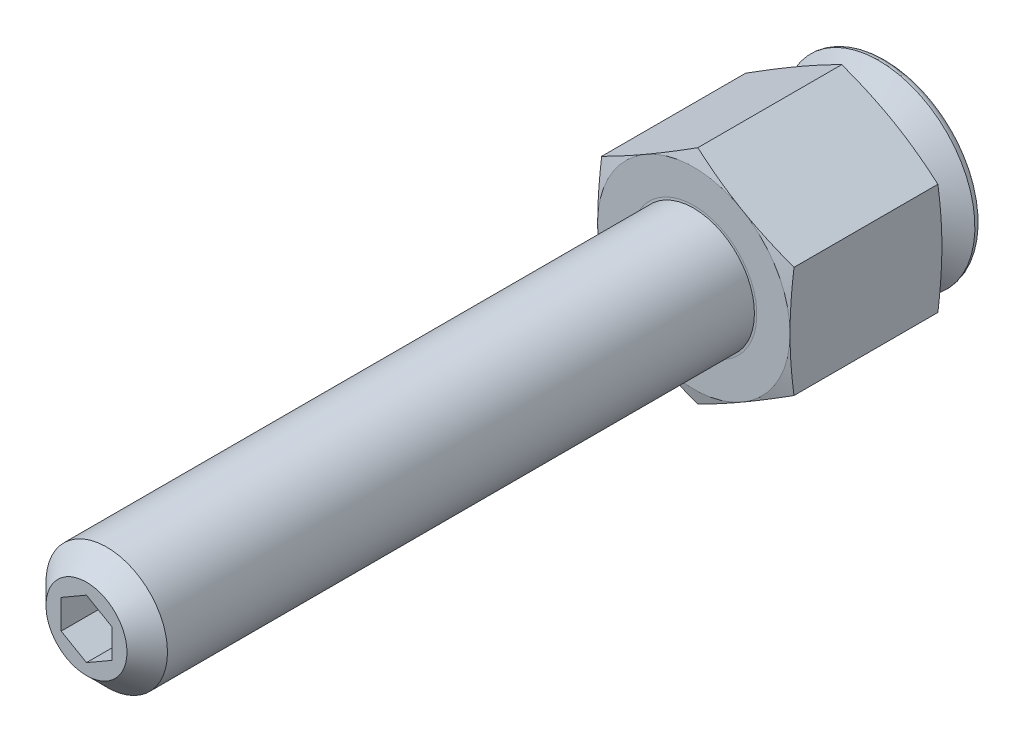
ISO-10303-21;
HEADER;
FILE_DESCRIPTION(('STEP AP214'),'2;1');
FILE_NAME('part.step','',(''),(''),'','','');
FILE_SCHEMA(('AUTOMOTIVE_DESIGN { 1 0 10303 214 1 1 1 1 }'));
ENDSEC;
DATA;
#1=APPLICATION_CONTEXT('core data for automotive mechanical design processes');
#2=APPLICATION_PROTOCOL_DEFINITION('international standard','automotive_design',2000,#1);
#3=PRODUCT_CONTEXT('',#1,'mechanical');
#4=PRODUCT('Part','Part','',(#3));
#5=PRODUCT_RELATED_PRODUCT_CATEGORY('part','',(#4));
#6=PRODUCT_DEFINITION_FORMATION('','',#4);
#7=PRODUCT_DEFINITION_CONTEXT('part definition',#1,'design');
#8=PRODUCT_DEFINITION('design','',#6,#7);
#9=PRODUCT_DEFINITION_SHAPE('','',#8);
#10=(LENGTH_UNIT() NAMED_UNIT(*) SI_UNIT(.MILLI.,.METRE.));
#11=(NAMED_UNIT(*) PLANE_ANGLE_UNIT() SI_UNIT($,.RADIAN.));
#12=(NAMED_UNIT(*) SI_UNIT($,.STERADIAN.) SOLID_ANGLE_UNIT());
#13=UNCERTAINTY_MEASURE_WITH_UNIT(LENGTH_MEASURE(1.E-05),#10,'distance_accuracy_value','');
#14=(GEOMETRIC_REPRESENTATION_CONTEXT(3) GLOBAL_UNCERTAINTY_ASSIGNED_CONTEXT((#13)) GLOBAL_UNIT_ASSIGNED_CONTEXT((#10,
#11,#12)) REPRESENTATION_CONTEXT('',''));
#15=CARTESIAN_POINT('',(0.,0.,0.));
#16=DIRECTION('',(0.,0.,1.));
#17=DIRECTION('',(1.,0.,0.));
#18=AXIS2_PLACEMENT_3D('',#15,#16,#17);
#19=CARTESIAN_POINT('',(0.,0.,6.775599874));
#20=DIRECTION('',(0.,0.,-1.));
#21=DIRECTION('',(-0.24616653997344,0.969227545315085,0.));
#22=AXIS2_PLACEMENT_3D('',#19,#20,#21);
#23=SPHERICAL_SURFACE('',#22,7.5);
#24=CARTESIAN_POINT('',(0.,0.,4.9143998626));
#25=DIRECTION('',(0.,0.,-1.));
#26=DIRECTION('',(0.24616653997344,-0.969227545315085,0.));
#27=AXIS2_PLACEMENT_3D('',#24,#25,#26);
#28=CIRCLE('',#27,7.26539293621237);
#29=CARTESIAN_POINT('',(-1.78849664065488,7.04181896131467,4.9143998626));
#30=VERTEX_POINT('',#29);
#31=EDGE_CURVE('E9',#30,#30,#28,.F.);
#32=CARTESIAN_POINT('',(0.,0.,3.78746603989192));
#33=DIRECTION('',(0.,0.,1.));
#34=DIRECTION('',(-0.24616653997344,0.969227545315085,0.));
#35=AXIS2_PLACEMENT_3D('',#32,#33,#34);
#36=CIRCLE('',#35,6.87903017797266);
#37=CARTESIAN_POINT('',(-1.69338705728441,6.66734553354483,3.78746603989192));
#38=VERTEX_POINT('',#37);
#39=EDGE_CURVE('E358',#38,#38,#36,.T.);
#40=CARTESIAN_POINT('',(-1.78849664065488,7.04181896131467,4.9143998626));
#41=CARTESIAN_POINT('',(-1.78773775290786,7.03883100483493,4.90236573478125));
#42=CARTESIAN_POINT('',(-1.78697150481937,7.03581406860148,4.89033926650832));
#43=CARTESIAN_POINT('',(-1.78542430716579,7.02972231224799,4.86630194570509));
#44=CARTESIAN_POINT('',(-1.78464335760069,7.02664749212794,4.85429109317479));
#45=CARTESIAN_POINT('',(-1.78306677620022,7.02044004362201,4.83028530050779));
#46=CARTESIAN_POINT('',(-1.78227114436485,7.01730741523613,4.81829036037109));
#47=CARTESIAN_POINT('',(-1.78066521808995,7.0109844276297,4.79431668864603));
#48=CARTESIAN_POINT('',(-1.77985492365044,7.00779406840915,4.78233795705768));
#49=CARTESIAN_POINT('',(-1.77821969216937,7.00135569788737,4.75839699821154));
#50=CARTESIAN_POINT('',(-1.77739475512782,6.99810768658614,4.74643477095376));
#51=CARTESIAN_POINT('',(-1.77573025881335,6.99155409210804,4.72252711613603));
#52=CARTESIAN_POINT('',(-1.77489069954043,6.98824850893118,4.7105816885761));
#53=CARTESIAN_POINT('',(-1.77319697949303,6.98157985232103,4.68670792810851));
#54=CARTESIAN_POINT('',(-1.77234281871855,6.97821677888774,4.67477959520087));
#55=CARTESIAN_POINT('',(-1.77061991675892,6.97143322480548,4.6509403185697));
#56=CARTESIAN_POINT('',(-1.76975117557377,6.96801274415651,4.63902937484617));
#57=CARTESIAN_POINT('',(-1.76799913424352,6.96111446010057,4.61522517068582));
#58=CARTESIAN_POINT('',(-1.76711583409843,6.95763665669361,4.603331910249));
#59=CARTESIAN_POINT('',(-1.76533469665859,6.95062381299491,4.57956336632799));
#60=CARTESIAN_POINT('',(-1.76443685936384,6.94708877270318,4.5676880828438));
#61=CARTESIAN_POINT('',(-1.7626266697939,6.93996154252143,4.5439557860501));
#62=CARTESIAN_POINT('',(-1.7617143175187,6.93636935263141,4.53209877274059));
#63=CARTESIAN_POINT('',(-1.75987512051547,6.92912791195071,4.50840330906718));
#64=CARTESIAN_POINT('',(-1.75894827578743,6.92547866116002,4.49656485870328));
#65=CARTESIAN_POINT('',(-1.75708011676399,6.91812318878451,4.47290681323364));
#66=CARTESIAN_POINT('',(-1.75613880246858,6.9144169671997,4.46108721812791));
#67=CARTESIAN_POINT('',(-1.75424172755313,6.90694764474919,4.43746717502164));
#68=CARTESIAN_POINT('',(-1.75328596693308,6.90318454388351,4.42566672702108));
#69=CARTESIAN_POINT('',(-1.7513600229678,6.89560155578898,4.40208526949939));
#70=CARTESIAN_POINT('',(-1.75038983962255,6.89178166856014,4.39030425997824));
#71=CARTESIAN_POINT('',(-1.74843507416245,6.88408520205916,4.3667619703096));
#72=CARTESIAN_POINT('',(-1.74745049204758,6.88020862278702,4.3550006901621));
#73=CARTESIAN_POINT('',(-1.74546695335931,6.87239886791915,4.33149814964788));
#74=CARTESIAN_POINT('',(-1.74446799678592,6.86846569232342,4.31975688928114));
#75=CARTESIAN_POINT('',(-1.74245573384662,6.86054284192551,4.29629467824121));
#76=CARTESIAN_POINT('',(-1.74144242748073,6.85655316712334,4.28457372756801));
#77=CARTESIAN_POINT('',(-1.73940148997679,6.84851741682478,4.26115242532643));
#78=CARTESIAN_POINT('',(-1.73837385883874,6.8444713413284,4.24945207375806));
#79=CARTESIAN_POINT('',(-1.73630429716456,6.83632288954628,4.2260722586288));
#80=CARTESIAN_POINT('',(-1.73526236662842,6.83222051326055,4.21439279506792));
#81=CARTESIAN_POINT('',(-1.73316423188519,6.82395956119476,4.19105504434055));
#82=CARTESIAN_POINT('',(-1.7321080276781,6.8198009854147,4.17939675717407));
#83=CARTESIAN_POINT('',(-1.72998137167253,6.81142773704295,4.1561016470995));
#84=CARTESIAN_POINT('',(-1.72891091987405,6.80721306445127,4.14446482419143));
#85=CARTESIAN_POINT('',(-1.72675579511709,6.79872772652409,4.12121292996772));
#86=CARTESIAN_POINT('',(-1.7256711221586,6.7944570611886,4.10959785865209));
#87=CARTESIAN_POINT('',(-1.72348758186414,6.78585984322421,4.08638975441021));
#88=CARTESIAN_POINT('',(-1.72238871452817,6.7815332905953,4.07479672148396));
#89=CARTESIAN_POINT('',(-1.72017681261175,6.77282440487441,4.05163298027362));
#90=CARTESIAN_POINT('',(-1.71906377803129,6.76844207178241,4.04006227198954));
#91=CARTESIAN_POINT('',(-1.71682356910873,6.75962173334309,4.01694346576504));
#92=CARTESIAN_POINT('',(-1.71569639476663,6.75518372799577,4.00539536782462));
#93=CARTESIAN_POINT('',(-1.71342793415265,6.74625215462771,3.98232206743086));
#94=CARTESIAN_POINT('',(-1.71228664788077,6.74175858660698,3.97079686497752));
#95=CARTESIAN_POINT('',(-1.709989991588,6.73271599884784,3.94776964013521));
#96=CARTESIAN_POINT('',(-1.70883462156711,6.72816697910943,3.93626761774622));
#97=CARTESIAN_POINT('',(-1.70650982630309,6.71901360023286,3.91328703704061));
#98=CARTESIAN_POINT('',(-1.70534040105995,6.71440924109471,3.90180847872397));
#99=CARTESIAN_POINT('',(-1.70298752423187,6.70514529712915,3.87887510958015));
#100=CARTESIAN_POINT('',(-1.70180407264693,6.70048571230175,3.86742029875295));
#101=CARTESIAN_POINT('',(-1.69942317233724,6.6911114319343,3.84453470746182));
#102=CARTESIAN_POINT('',(-1.6982257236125,6.68639673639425,3.83310392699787));
#103=CARTESIAN_POINT('',(-1.69581685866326,6.67691235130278,3.81026667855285));
#104=CARTESIAN_POINT('',(-1.69460544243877,6.67214266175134,3.79886021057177));
#105=CARTESIAN_POINT('',(-1.69338705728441,6.66734553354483,3.78746603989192));
#106=B_SPLINE_CURVE_WITH_KNOTS('',3,(#40,#41,#42,#43,#44,#45,#46,#47,#48,#49,#50,#51,#52,#53,
#54,#55,#56,#57,#58,#59,#60,#61,#62,#63,#64,#65,#66,#67,#68,#69,#70,#71,#72,#73,#74,#75,#76,#77,
#78,#79,#80,#81,#82,#83,#84,#85,#86,#87,#88,#89,#90,#91,#92,#93,#94,#95,#96,#97,#98,#99,#100,
#101,#102,#103,#104,#105),.UNSPECIFIED.,.F.,.F.,(4,2,2,2,2,2,2,2,2,2,2,2,2,2,2,2,2,2,2,2,2,2,2,
2,2,2,2,2,2,2,2,2,4),(0.,0.0372681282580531,0.0745362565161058,0.111804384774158,
0.149072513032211,0.186340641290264,0.223608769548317,0.260876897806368,0.298145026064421,
0.335413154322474,0.372681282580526,0.409949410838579,0.447217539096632,0.484485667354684,
0.521753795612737,0.55902192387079,0.596290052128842,0.633558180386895,0.670826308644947,
0.708094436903,0.745362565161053,0.782630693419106,0.819898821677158,0.857166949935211,
0.894435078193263,0.931703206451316,0.968971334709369,1.00623946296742,1.04350759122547,
1.08077571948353,1.11804384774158,1.15531197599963,1.19258010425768),.UNSPECIFIED.);
#107=EDGE_CURVE('BSEAM14',#30,#38,#106,.T.);
#108=ORIENTED_EDGE('',*,*,#31,.F.);
#109=ORIENTED_EDGE('',*,*,#39,.T.);
#110=ORIENTED_EDGE('',*,*,#107,.T.);
#111=ORIENTED_EDGE('',*,*,#107,.F.);
#112=EDGE_LOOP('',(#108,#110,#109,#111));
#113=FACE_BOUND('',#112,.T.);
#114=ADVANCED_FACE('F14',(#113),#23,.T.);
#115=CARTESIAN_POINT('',(0.,0.,0.));
#116=DIRECTION('',(0.,0.,-1.));
#117=DIRECTION('',(0.24616653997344,-0.969227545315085,0.));
#118=AXIS2_PLACEMENT_3D('',#115,#116,#117);
#119=CYLINDRICAL_SURFACE('',#118,6.858);
#120=CARTESIAN_POINT('',(0.,0.,3.68626790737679));
#121=DIRECTION('',(0.,0.,1.));
#122=DIRECTION('',(-0.24616653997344,0.969227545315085,0.));
#123=AXIS2_PLACEMENT_3D('',#120,#121,#122);
#124=CIRCLE('',#123,6.858);
#125=CARTESIAN_POINT('',(-1.68821013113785,6.64696250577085,3.68626790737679));
#126=VERTEX_POINT('',#125);
#127=EDGE_CURVE('E356',#126,#126,#124,.F.);
#128=ORIENTED_EDGE('',*,*,#127,.T.);
#129=EDGE_LOOP('',(#128));
#130=FACE_BOUND('',#129,.T.);
#131=CARTESIAN_POINT('',(0.,0.,2.43400637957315));
#132=DIRECTION('',(0.,0.,-1.));
#133=DIRECTION('',(0.24616653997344,-0.969227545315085,0.));
#134=AXIS2_PLACEMENT_3D('',#131,#132,#133);
#135=CIRCLE('',#134,6.858);
#136=CARTESIAN_POINT('',(1.68821013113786,-6.64696250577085,2.43400637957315));
#137=VERTEX_POINT('',#136);
#138=EDGE_CURVE('E353',#137,#137,#135,.F.);
#139=ORIENTED_EDGE('',*,*,#138,.T.);
#140=EDGE_LOOP('',(#139));
#141=FACE_BOUND('',#140,.T.);
#142=ADVANCED_FACE('F377',(#130,#141),#119,.T.);
#143=CARTESIAN_POINT('',(0.,0.,2.28735941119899));
#144=DIRECTION('',(0.,0.,-1.));
#145=DIRECTION('',(0.24616653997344,-0.969227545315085,0.));
#146=AXIS2_PLACEMENT_3D('',#143,#144,#145);
#147=CONICAL_SURFACE('',#146,6.858,1.0471975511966);
#148=CARTESIAN_POINT('',(0.,0.,2.2140359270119));
#149=DIRECTION('',(0.,0.,-1.));
#150=DIRECTION('',(0.24616653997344,-0.969227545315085,0.));
#151=AXIS2_PLACEMENT_3D('',#148,#149,#150);
#152=CIRCLE('',#151,6.985);
#153=CARTESIAN_POINT('',(1.71947328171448,-6.77005440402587,2.2140359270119));
#154=VERTEX_POINT('',#153);
#155=EDGE_CURVE('E18',#154,#154,#152,.T.);
#156=ORIENTED_EDGE('',*,*,#155,.T.);
#157=EDGE_LOOP('',(#156));
#158=FACE_BOUND('',#157,.T.);
#159=CARTESIAN_POINT('',(0.,0.,0.762));
#160=DIRECTION('',(0.,0.,-1.));
#161=DIRECTION('',(0.24616653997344,-0.969227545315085,0.));
#162=AXIS2_PLACEMENT_3D('',#159,#160,#161);
#163=CIRCLE('',#162,9.5);
#164=CARTESIAN_POINT('',(2.33858212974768,-9.20766168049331,0.762));
#165=VERTEX_POINT('',#164);
#166=EDGE_CURVE('E347',#165,#165,#163,.T.);
#167=ORIENTED_EDGE('',*,*,#166,.F.);
#168=EDGE_LOOP('',(#167));
#169=FACE_BOUND('',#168,.T.);
#170=ADVANCED_FACE('F383',(#158,#169),#147,.T.);
#171=CARTESIAN_POINT('',(-2.33858212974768,9.20766168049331,0.));
#172=DIRECTION('',(0.,0.,1.));
#173=DIRECTION('',(-0.24616653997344,0.969227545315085,0.));
#174=AXIS2_PLACEMENT_3D('',#171,#172,#173);
#175=PLANE('',#174);
#176=CARTESIAN_POINT('',(0.,0.,0.));
#177=DIRECTION('',(0.,0.,1.));
#178=DIRECTION('',(-0.24616653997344,0.969227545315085,0.));
#179=AXIS2_PLACEMENT_3D('',#176,#177,#178);
#180=CIRCLE('',#179,8.738);
#181=CARTESIAN_POINT('',(-2.15100322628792,8.46911029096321,0.));
#182=VERTEX_POINT('',#181);
#183=EDGE_CURVE('E350',#182,#182,#180,.F.);
#184=ORIENTED_EDGE('',*,*,#183,.T.);
#185=EDGE_LOOP('',(#184));
#186=FACE_BOUND('',#185,.T.);
#187=ADVANCED_FACE('F491',(#186),#175,.F.);
#188=CARTESIAN_POINT('',(0.,0.,0.762));
#189=DIRECTION('',(0.,0.,1.));
#190=DIRECTION('',(-0.24616653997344,0.969227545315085,0.));
#191=AXIS2_PLACEMENT_3D('',#188,#189,#190);
#192=TOROIDAL_SURFACE('',#191,8.738,0.762);
#193=ORIENTED_EDGE('',*,*,#166,.T.);
#194=EDGE_LOOP('',(#193));
#195=FACE_BOUND('',#194,.T.);
#196=ORIENTED_EDGE('',*,*,#183,.F.);
#197=EDGE_LOOP('',(#196));
#198=FACE_BOUND('',#197,.T.);
#199=ADVANCED_FACE('F494',(#195,#198),#192,.T.);
#200=CARTESIAN_POINT('',(0.,0.,3.68626790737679));
#201=DIRECTION('',(0.,0.,1.));
#202=DIRECTION('',(-0.24616653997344,0.969227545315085,0.));
#203=AXIS2_PLACEMENT_3D('',#200,#201,#202);
#204=TOROIDAL_SURFACE('',#203,7.112,0.254);
#205=ORIENTED_EDGE('',*,*,#39,.F.);
#206=EDGE_LOOP('',(#205));
#207=FACE_BOUND('',#206,.T.);
#208=ORIENTED_EDGE('',*,*,#127,.F.);
#209=EDGE_LOOP('',(#208));
#210=FACE_BOUND('',#209,.T.);
#211=ADVANCED_FACE('F395',(#207,#210),#204,.F.);
#212=CARTESIAN_POINT('',(0.,0.,2.43400637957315));
#213=DIRECTION('',(0.,0.,-1.));
#214=DIRECTION('',(0.24616653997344,-0.969227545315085,0.));
#215=AXIS2_PLACEMENT_3D('',#212,#213,#214);
#216=TOROIDAL_SURFACE('',#215,7.112,0.254);
#217=ORIENTED_EDGE('',*,*,#138,.F.);
#218=EDGE_LOOP('',(#217));
#219=FACE_BOUND('',#218,.T.);
#220=ORIENTED_EDGE('',*,*,#155,.F.);
#221=EDGE_LOOP('',(#220));
#222=FACE_BOUND('',#221,.T.);
#223=ADVANCED_FACE('F16',(#219,#222),#216,.F.);
#224=CARTESIAN_POINT('',(5.,0.,74.0253998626));
#225=DIRECTION('',(0.,0.,-1.));
#226=DIRECTION('',(-1.,0.,0.));
#227=AXIS2_PLACEMENT_3D('',#224,#225,#226);
#228=PLANE('',#227);
#229=DIRECTION('',(-0.866025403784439,0.5,0.));
#230=VECTOR('',#229,1.);
#231=CARTESIAN_POINT('',(2.5,1.44337567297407,74.0253998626));
#232=LINE('',#231,#230);
#233=CARTESIAN_POINT('',(2.5,1.44337567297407,74.0253998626));
#234=VERTEX_POINT('',#233);
#235=CARTESIAN_POINT('',(0.,2.88675134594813,74.0253998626));
#236=VERTEX_POINT('',#235);
#237=EDGE_CURVE('E143',#234,#236,#232,.T.);
#238=ORIENTED_EDGE('',*,*,#237,.T.);
#239=DIRECTION('',(-0.866025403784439,-0.5,0.));
#240=VECTOR('',#239,1.);
#241=CARTESIAN_POINT('',(0.,2.88675134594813,74.0253998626));
#242=LINE('',#241,#240);
#243=CARTESIAN_POINT('',(-2.5,1.44337567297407,74.0253998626));
#244=VERTEX_POINT('',#243);
#245=EDGE_CURVE('E152',#236,#244,#242,.T.);
#246=ORIENTED_EDGE('',*,*,#245,.T.);
#247=DIRECTION('',(0.,-1.,0.));
#248=VECTOR('',#247,1.);
#249=CARTESIAN_POINT('',(-2.5,1.44337567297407,74.0253998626));
#250=LINE('',#249,#248);
#251=CARTESIAN_POINT('',(-2.5,-1.44337567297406,74.0253998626));
#252=VERTEX_POINT('',#251);
#253=EDGE_CURVE('E157',#244,#252,#250,.T.);
#254=ORIENTED_EDGE('',*,*,#253,.T.);
#255=DIRECTION('',(0.866025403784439,-0.5,0.));
#256=VECTOR('',#255,1.);
#257=CARTESIAN_POINT('',(-2.5,-1.44337567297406,74.0253998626));
#258=LINE('',#257,#256);
#259=CARTESIAN_POINT('',(0.,-2.88675134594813,74.0253998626));
#260=VERTEX_POINT('',#259);
#261=EDGE_CURVE('E171',#252,#260,#258,.T.);
#262=ORIENTED_EDGE('',*,*,#261,.T.);
#263=DIRECTION('',(0.866025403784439,0.5,0.));
#264=VECTOR('',#263,1.);
#265=CARTESIAN_POINT('',(0.,-2.88675134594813,74.0253998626));
#266=LINE('',#265,#264);
#267=CARTESIAN_POINT('',(2.5,-1.44337567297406,74.0253998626));
#268=VERTEX_POINT('',#267);
#269=EDGE_CURVE('E174',#260,#268,#266,.T.);
#270=ORIENTED_EDGE('',*,*,#269,.T.);
#271=DIRECTION('',(0.,1.,0.));
#272=VECTOR('',#271,1.);
#273=CARTESIAN_POINT('',(2.5,-1.44337567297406,74.0253998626));
#274=LINE('',#273,#272);
#275=EDGE_CURVE('E149',#268,#234,#274,.T.);
#276=ORIENTED_EDGE('',*,*,#275,.T.);
#277=EDGE_LOOP('',(#238,#246,#254,#262,#270,#276));
#278=FACE_BOUND('',#277,.T.);
#279=ADVANCED_FACE('F159',(#278),#228,.F.);
#280=CARTESIAN_POINT('',(0.,2.88675134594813,74.0253998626));
#281=DIRECTION('',(-0.5,0.866025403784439,0.));
#282=DIRECTION('',(0.866025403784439,0.5,0.));
#283=AXIS2_PLACEMENT_3D('',#280,#281,#282);
#284=PLANE('',#283);
#285=DIRECTION('',(-0.866025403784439,-0.5,0.));
#286=VECTOR('',#285,1.);
#287=CARTESIAN_POINT('',(0.,2.88675134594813,79.0253998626));
#288=LINE('',#287,#286);
#289=CARTESIAN_POINT('',(0.,2.88675134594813,79.0253998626));
#290=VERTEX_POINT('',#289);
#291=CARTESIAN_POINT('',(-2.5,1.44337567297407,79.0253998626));
#292=VERTEX_POINT('',#291);
#293=EDGE_CURVE('E178',#290,#292,#288,.T.);
#294=ORIENTED_EDGE('',*,*,#293,.T.);
#295=DIRECTION('',(0.,0.,1.));
#296=VECTOR('',#295,1.);
#297=CARTESIAN_POINT('',(-2.5,1.44337567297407,74.0253998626));
#298=LINE('',#297,#296);
#299=EDGE_CURVE('E148',#244,#292,#298,.T.);
#300=ORIENTED_EDGE('',*,*,#299,.F.);
#301=ORIENTED_EDGE('',*,*,#245,.F.);
#302=DIRECTION('',(0.,0.,1.));
#303=VECTOR('',#302,1.);
#304=CARTESIAN_POINT('',(0.,2.88675134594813,74.0253998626));
#305=LINE('',#304,#303);
#306=EDGE_CURVE('E139',#236,#290,#305,.T.);
#307=ORIENTED_EDGE('',*,*,#306,.T.);
#308=EDGE_LOOP('',(#294,#300,#301,#307));
#309=FACE_BOUND('',#308,.T.);
#310=ADVANCED_FACE('F153',(#309),#284,.F.);
#311=CARTESIAN_POINT('',(-2.5,1.44337567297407,74.0253998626));
#312=DIRECTION('',(-1.,0.,0.));
#313=DIRECTION('',(0.,1.,0.));
#314=AXIS2_PLACEMENT_3D('',#311,#312,#313);
#315=PLANE('',#314);
#316=DIRECTION('',(0.,-1.,0.));
#317=VECTOR('',#316,1.);
#318=CARTESIAN_POINT('',(-2.5,1.44337567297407,79.0253998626));
#319=LINE('',#318,#317);
#320=CARTESIAN_POINT('',(-2.5,-1.44337567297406,79.0253998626));
#321=VERTEX_POINT('',#320);
#322=EDGE_CURVE('E180',#292,#321,#319,.T.);
#323=ORIENTED_EDGE('',*,*,#322,.T.);
#324=DIRECTION('',(0.,0.,1.));
#325=VECTOR('',#324,1.);
#326=CARTESIAN_POINT('',(-2.5,-1.44337567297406,74.0253998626));
#327=LINE('',#326,#325);
#328=EDGE_CURVE('E195',#252,#321,#327,.T.);
#329=ORIENTED_EDGE('',*,*,#328,.F.);
#330=ORIENTED_EDGE('',*,*,#253,.F.);
#331=ORIENTED_EDGE('',*,*,#299,.T.);
#332=EDGE_LOOP('',(#323,#329,#330,#331));
#333=FACE_BOUND('',#332,.T.);
#334=ADVANCED_FACE('F393',(#333),#315,.F.);
#335=CARTESIAN_POINT('',(-2.5,-1.44337567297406,74.0253998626));
#336=DIRECTION('',(-0.5,-0.866025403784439,0.));
#337=DIRECTION('',(-0.866025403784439,0.5,0.));
#338=AXIS2_PLACEMENT_3D('',#335,#336,#337);
#339=PLANE('',#338);
#340=DIRECTION('',(0.866025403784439,-0.5,0.));
#341=VECTOR('',#340,1.);
#342=CARTESIAN_POINT('',(-2.5,-1.44337567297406,79.0253998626));
#343=LINE('',#342,#341);
#344=CARTESIAN_POINT('',(0.,-2.88675134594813,79.0253998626));
#345=VERTEX_POINT('',#344);
#346=EDGE_CURVE('E183',#321,#345,#343,.T.);
#347=ORIENTED_EDGE('',*,*,#346,.T.);
#348=DIRECTION('',(0.,0.,1.));
#349=VECTOR('',#348,1.);
#350=CARTESIAN_POINT('',(0.,-2.88675134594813,74.0253998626));
#351=LINE('',#350,#349);
#352=EDGE_CURVE('E193',#260,#345,#351,.T.);
#353=ORIENTED_EDGE('',*,*,#352,.F.);
#354=ORIENTED_EDGE('',*,*,#261,.F.);
#355=ORIENTED_EDGE('',*,*,#328,.T.);
#356=EDGE_LOOP('',(#347,#353,#354,#355));
#357=FACE_BOUND('',#356,.T.);
#358=ADVANCED_FACE('F405',(#357),#339,.F.);
#359=CARTESIAN_POINT('',(0.,-2.88675134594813,74.0253998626));
#360=DIRECTION('',(0.5,-0.866025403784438,0.));
#361=DIRECTION('',(-0.866025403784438,-0.5,0.));
#362=AXIS2_PLACEMENT_3D('',#359,#360,#361);
#363=PLANE('',#362);
#364=DIRECTION('',(0.866025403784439,0.5,0.));
#365=VECTOR('',#364,1.);
#366=CARTESIAN_POINT('',(0.,-2.88675134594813,79.0253998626));
#367=LINE('',#366,#365);
#368=CARTESIAN_POINT('',(2.5,-1.44337567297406,79.0253998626));
#369=VERTEX_POINT('',#368);
#370=EDGE_CURVE('E165',#345,#369,#367,.T.);
#371=ORIENTED_EDGE('',*,*,#370,.T.);
#372=DIRECTION('',(0.,0.,1.));
#373=VECTOR('',#372,1.);
#374=CARTESIAN_POINT('',(2.5,-1.44337567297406,74.0253998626));
#375=LINE('',#374,#373);
#376=EDGE_CURVE('E191',#268,#369,#375,.T.);
#377=ORIENTED_EDGE('',*,*,#376,.F.);
#378=ORIENTED_EDGE('',*,*,#269,.F.);
#379=ORIENTED_EDGE('',*,*,#352,.T.);
#380=EDGE_LOOP('',(#371,#377,#378,#379));
#381=FACE_BOUND('',#380,.T.);
#382=ADVANCED_FACE('F401',(#381),#363,.F.);
#383=CARTESIAN_POINT('',(2.5,-1.44337567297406,74.0253998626));
#384=DIRECTION('',(1.,0.,0.));
#385=DIRECTION('',(0.,0.,-1.));
#386=AXIS2_PLACEMENT_3D('',#383,#384,#385);
#387=PLANE('',#386);
#388=DIRECTION('',(0.,1.,0.));
#389=VECTOR('',#388,1.);
#390=CARTESIAN_POINT('',(2.5,-1.44337567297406,79.0253998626));
#391=LINE('',#390,#389);
#392=CARTESIAN_POINT('',(2.5,1.44337567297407,79.0253998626));
#393=VERTEX_POINT('',#392);
#394=EDGE_CURVE('E162',#369,#393,#391,.T.);
#395=ORIENTED_EDGE('',*,*,#394,.T.);
#396=DIRECTION('',(0.,0.,1.));
#397=VECTOR('',#396,1.);
#398=CARTESIAN_POINT('',(2.5,1.44337567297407,74.0253998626));
#399=LINE('',#398,#397);
#400=EDGE_CURVE('E188',#234,#393,#399,.T.);
#401=ORIENTED_EDGE('',*,*,#400,.F.);
#402=ORIENTED_EDGE('',*,*,#275,.F.);
#403=ORIENTED_EDGE('',*,*,#376,.T.);
#404=EDGE_LOOP('',(#395,#401,#402,#403));
#405=FACE_BOUND('',#404,.T.);
#406=ADVANCED_FACE('F398',(#405),#387,.F.);
#407=CARTESIAN_POINT('',(2.5,1.44337567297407,74.0253998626));
#408=DIRECTION('',(0.5,0.866025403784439,0.));
#409=DIRECTION('',(0.866025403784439,-0.5,0.));
#410=AXIS2_PLACEMENT_3D('',#407,#408,#409);
#411=PLANE('',#410);
#412=DIRECTION('',(-0.866025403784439,0.5,0.));
#413=VECTOR('',#412,1.);
#414=CARTESIAN_POINT('',(2.5,1.44337567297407,79.0253998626));
#415=LINE('',#414,#413);
#416=EDGE_CURVE('E31',#393,#290,#415,.T.);
#417=ORIENTED_EDGE('',*,*,#416,.T.);
#418=ORIENTED_EDGE('',*,*,#306,.F.);
#419=ORIENTED_EDGE('',*,*,#237,.F.);
#420=ORIENTED_EDGE('',*,*,#400,.T.);
#421=EDGE_LOOP('',(#417,#418,#419,#420));
#422=FACE_BOUND('',#421,.T.);
#423=ADVANCED_FACE('F141',(#422),#411,.F.);
#424=CARTESIAN_POINT('',(0.,0.,79.0253998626));
#425=DIRECTION('',(0.,0.,1.));
#426=DIRECTION('',(1.,0.,0.));
#427=AXIS2_PLACEMENT_3D('',#424,#425,#426);
#428=PLANE('',#427);
#429=ORIENTED_EDGE('',*,*,#416,.F.);
#430=ORIENTED_EDGE('',*,*,#394,.F.);
#431=ORIENTED_EDGE('',*,*,#370,.F.);
#432=ORIENTED_EDGE('',*,*,#346,.F.);
#433=ORIENTED_EDGE('',*,*,#322,.F.);
#434=ORIENTED_EDGE('',*,*,#293,.F.);
#435=EDGE_LOOP('',(#429,#430,#431,#432,#433,#434));
#436=FACE_BOUND('',#435,.T.);
#437=CARTESIAN_POINT('',(0.,0.,79.0253998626));
#438=DIRECTION('',(0.,0.,1.));
#439=DIRECTION('',(1.,0.,0.));
#440=AXIS2_PLACEMENT_3D('',#437,#438,#439);
#441=CIRCLE('',#440,4.);
#442=CARTESIAN_POINT('',(4.,0.,79.0253998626));
#443=VERTEX_POINT('',#442);
#444=EDGE_CURVE('E342',#443,#443,#441,.T.);
#445=ORIENTED_EDGE('',*,*,#444,.T.);
#446=EDGE_LOOP('',(#445));
#447=FACE_BOUND('',#446,.T.);
#448=ADVANCED_FACE('F415',(#436,#447),#428,.T.);
#449=CARTESIAN_POINT('',(0.,0.,79.0253998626));
#450=DIRECTION('',(0.,0.,-1.));
#451=DIRECTION('',(-1.,0.,0.));
#452=AXIS2_PLACEMENT_3D('',#449,#450,#451);
#453=CONICAL_SURFACE('',#452,4.,0.785398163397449);
#454=CARTESIAN_POINT('',(0.,0.,77.0253998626));
#455=DIRECTION('',(0.,0.,1.));
#456=DIRECTION('',(1.,0.,0.));
#457=AXIS2_PLACEMENT_3D('',#454,#455,#456);
#458=CIRCLE('',#457,6.);
#459=CARTESIAN_POINT('',(6.,0.,77.0253998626));
#460=VERTEX_POINT('',#459);
#461=EDGE_CURVE('E23',#460,#460,#458,.F.);
#462=ORIENTED_EDGE('',*,*,#461,.F.);
#463=EDGE_LOOP('',(#462));
#464=FACE_BOUND('',#463,.T.);
#465=ORIENTED_EDGE('',*,*,#444,.F.);
#466=EDGE_LOOP('',(#465));
#467=FACE_BOUND('',#466,.T.);
#468=ADVANCED_FACE('F417',(#464,#467),#453,.T.);
#469=CARTESIAN_POINT('',(0.,0.,79.0253998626));
#470=DIRECTION('',(0.,0.,-1.));
#471=DIRECTION('',(-1.,0.,0.));
#472=AXIS2_PLACEMENT_3D('',#469,#470,#471);
#473=CYLINDRICAL_SURFACE('',#472,6.);
#474=ORIENTED_EDGE('',*,*,#461,.T.);
#475=EDGE_LOOP('',(#474));
#476=FACE_BOUND('',#475,.T.);
#477=CARTESIAN_POINT('',(0.,0.,19.0418034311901));
#478=DIRECTION('',(0.,0.,1.));
#479=DIRECTION('',(1.,0.,0.));
#480=AXIS2_PLACEMENT_3D('',#477,#478,#479);
#481=CIRCLE('',#480,6.);
#482=CARTESIAN_POINT('',(6.,0.,19.0418034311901));
#483=VERTEX_POINT('',#482);
#484=EDGE_CURVE('E190',#483,#483,#481,.F.);
#485=ORIENTED_EDGE('',*,*,#484,.F.);
#486=EDGE_LOOP('',(#485));
#487=FACE_BOUND('',#486,.T.);
#488=ADVANCED_FACE('F419',(#476,#487),#473,.T.);
#489=CARTESIAN_POINT('',(0.,0.,20.5493998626));
#490=DIRECTION('',(0.,0.,-1.));
#491=DIRECTION('',(-1.,0.,0.));
#492=AXIS2_PLACEMENT_3D('',#489,#490,#491);
#493=TOROIDAL_SURFACE('',#492,6.223,1.524);
#494=ORIENTED_EDGE('',*,*,#484,.T.);
#495=EDGE_LOOP('',(#494));
#496=FACE_BOUND('',#495,.T.);
#497=CARTESIAN_POINT('',(0.,0.,19.0253998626));
#498=DIRECTION('',(0.,0.,-1.));
#499=DIRECTION('',(-1.,0.,0.));
#500=AXIS2_PLACEMENT_3D('',#497,#498,#499);
#501=CIRCLE('',#500,6.223);
#502=CARTESIAN_POINT('',(-6.223,0.,19.0253998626));
#503=VERTEX_POINT('',#502);
#504=EDGE_CURVE('E339',#503,#503,#501,.T.);
#505=ORIENTED_EDGE('',*,*,#504,.F.);
#506=EDGE_LOOP('',(#505));
#507=FACE_BOUND('',#506,.T.);
#508=ADVANCED_FACE('F421',(#496,#507),#493,.F.);
#509=CARTESIAN_POINT('',(-9.5,16.4544826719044,19.0253998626));
#510=DIRECTION('',(0.,0.,-1.));
#511=DIRECTION('',(-1.,0.,0.));
#512=AXIS2_PLACEMENT_3D('',#509,#510,#511);
#513=PLANE('',#512);
#514=CARTESIAN_POINT('',(0.,0.,19.0253998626));
#515=DIRECTION('',(0.,0.,-1.));
#516=DIRECTION('',(-1.,0.,0.));
#517=AXIS2_PLACEMENT_3D('',#514,#515,#516);
#518=CIRCLE('',#517,9.5);
#519=CARTESIAN_POINT('',(-9.5,0.,19.0253998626));
#520=VERTEX_POINT('',#519);
#521=CARTESIAN_POINT('',(-4.75,8.22724133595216,19.0253998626));
#522=VERTEX_POINT('',#521);
#523=EDGE_CURVE('E451',#520,#522,#518,.T.);
#524=ORIENTED_EDGE('',*,*,#523,.F.);
#525=CARTESIAN_POINT('',(0.,0.,19.0253998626));
#526=DIRECTION('',(0.,0.,-1.));
#527=DIRECTION('',(-1.,0.,0.));
#528=AXIS2_PLACEMENT_3D('',#525,#526,#527);
#529=CIRCLE('',#528,9.5);
#530=CARTESIAN_POINT('',(-4.75,-8.22724133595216,19.0253998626));
#531=VERTEX_POINT('',#530);
#532=EDGE_CURVE('E308',#531,#520,#529,.T.);
#533=ORIENTED_EDGE('',*,*,#532,.F.);
#534=CARTESIAN_POINT('',(4.75,-8.22724133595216,19.0253998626));
#535=VERTEX_POINT('',#534);
#536=EDGE_CURVE('E326',#535,#531,#529,.T.);
#537=ORIENTED_EDGE('',*,*,#536,.F.);
#538=CARTESIAN_POINT('',(9.5,0.,19.0253998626));
#539=VERTEX_POINT('',#538);
#540=EDGE_CURVE('E819',#539,#535,#529,.T.);
#541=ORIENTED_EDGE('',*,*,#540,.F.);
#542=CARTESIAN_POINT('',(4.75,8.22724133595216,19.0253998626));
#543=VERTEX_POINT('',#542);
#544=EDGE_CURVE('E806',#543,#539,#529,.T.);
#545=ORIENTED_EDGE('',*,*,#544,.F.);
#546=EDGE_CURVE('E327',#522,#543,#529,.T.);
#547=ORIENTED_EDGE('',*,*,#546,.F.);
#548=EDGE_LOOP('',(#524,#533,#537,#541,#545,#547));
#549=FACE_BOUND('',#548,.T.);
#550=ORIENTED_EDGE('',*,*,#504,.T.);
#551=EDGE_LOOP('',(#550));
#552=FACE_BOUND('',#551,.T.);
#553=ADVANCED_FACE('F427',(#549,#552),#513,.F.);
#554=CARTESIAN_POINT('',(0.,0.,17.6112361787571));
#555=DIRECTION('',(0.,0.,-1.));
#556=DIRECTION('',(-1.,0.,0.));
#557=AXIS2_PLACEMENT_3D('',#554,#555,#556);
#558=CONICAL_SURFACE('',#557,14.7777307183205,1.30899693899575);
#559=CARTESIAN_POINT('',(9.5,-14.5747016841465,16.9092794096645));
#560=CARTESIAN_POINT('',(9.50000000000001,-14.1429588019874,17.0061686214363));
#561=CARTESIAN_POINT('',(9.50000000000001,-13.7109476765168,17.1018837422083));
#562=CARTESIAN_POINT('',(9.50000000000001,-12.8462570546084,17.2903319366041));
#563=CARTESIAN_POINT('',(9.50000000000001,-12.4135775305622,17.3830648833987));
#564=CARTESIAN_POINT('',(9.50000000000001,-11.5470400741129,17.5649936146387));
#565=CARTESIAN_POINT('',(9.50000000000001,-11.1131814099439,17.6541859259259));
#566=CARTESIAN_POINT('',(9.50000000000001,-10.2445657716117,17.828081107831));
#567=CARTESIAN_POINT('',(9.50000000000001,-9.80980880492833,17.9127840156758));
#568=CARTESIAN_POINT('',(9.50000000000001,-8.94271422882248,18.0759755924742));
#569=CARTESIAN_POINT('',(9.50000000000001,-8.51038497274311,18.1545084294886));
#570=CARTESIAN_POINT('',(9.50000000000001,-7.64453986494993,18.304791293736));
#571=CARTESIAN_POINT('',(9.50000000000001,-7.21102400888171,18.3765412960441));
#572=CARTESIAN_POINT('',(9.50000000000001,-6.34272998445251,18.5116537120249));
#573=CARTESIAN_POINT('',(9.50000000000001,-5.90795197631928,18.5750171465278));
#574=CARTESIAN_POINT('',(9.50000000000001,-5.03701035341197,18.6915021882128));
#575=CARTESIAN_POINT('',(9.5,-4.60084673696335,18.7446237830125));
#576=CARTESIAN_POINT('',(9.5,-3.72218440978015,18.8391354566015));
#577=CARTESIAN_POINT('',(9.5,-3.27967029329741,18.8803844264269));
#578=CARTESIAN_POINT('',(9.50000000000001,-2.39351554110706,18.9483138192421));
#579=CARTESIAN_POINT('',(9.5,-1.9498749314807,18.9749945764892));
#580=CARTESIAN_POINT('',(9.5,-1.06211305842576,19.0122322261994));
#581=CARTESIAN_POINT('',(9.5,-0.617992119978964,19.0227967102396));
#582=CARTESIAN_POINT('',(9.5,0.270333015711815,19.0271508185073));
#583=CARTESIAN_POINT('',(9.5,0.714537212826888,19.0209404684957));
#584=CARTESIAN_POINT('',(9.5,1.60403584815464,18.9920931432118));
#585=CARTESIAN_POINT('',(9.5,2.04932829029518,18.9693958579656));
#586=CARTESIAN_POINT('',(9.5,2.93887465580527,18.9088757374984));
#587=CARTESIAN_POINT('',(9.5,3.3831285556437,18.8710525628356));
#588=CARTESIAN_POINT('',(9.5,4.27059310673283,18.7822073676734));
#589=CARTESIAN_POINT('',(9.5,4.71380286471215,18.7311765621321));
#590=CARTESIAN_POINT('',(9.5,5.59879334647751,18.6180595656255));
#591=CARTESIAN_POINT('',(9.5,6.0405740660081,18.5559733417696));
#592=CARTESIAN_POINT('',(9.5,6.90095560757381,18.4260426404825));
#593=CARTESIAN_POINT('',(9.5,7.31962297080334,18.3586343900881));
#594=CARTESIAN_POINT('',(9.5,8.15583235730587,18.2171340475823));
#595=CARTESIAN_POINT('',(9.5,8.57337434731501,18.1430417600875));
#596=CARTESIAN_POINT('',(9.5,9.40749740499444,17.9894151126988));
#597=CARTESIAN_POINT('',(9.5,9.8240783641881,17.9098801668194));
#598=CARTESIAN_POINT('',(9.5,10.6563643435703,17.7463891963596));
#599=CARTESIAN_POINT('',(9.5,11.0720693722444,17.6624332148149));
#600=CARTESIAN_POINT('',(9.5,11.9028410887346,17.4908901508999));
#601=CARTESIAN_POINT('',(9.49999999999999,12.3179075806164,17.4033021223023));
#602=CARTESIAN_POINT('',(9.49999999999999,13.1474039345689,17.2251572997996));
#603=CARTESIAN_POINT('',(9.49999999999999,13.56183379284,17.1346004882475));
#604=CARTESIAN_POINT('',(9.49999999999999,14.804254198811,16.8592912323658));
#605=CARTESIAN_POINT('',(9.49999999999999,15.6314352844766,16.6708874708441));
#606=CARTESIAN_POINT('',(9.49999999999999,17.2759460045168,16.2892453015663));
#607=CARTESIAN_POINT('',(9.49999999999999,18.0932913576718,16.0960741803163));
#608=CARTESIAN_POINT('',(9.49999999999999,19.7268506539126,15.7049451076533));
#609=CARTESIAN_POINT('',(9.49999999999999,20.5430645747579,15.5069870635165));
#610=CARTESIAN_POINT('',(9.49999999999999,22.1735730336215,15.1077966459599));
#611=CARTESIAN_POINT('',(9.49999999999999,22.9878686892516,14.9065688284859));
#612=CARTESIAN_POINT('',(9.49999999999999,24.2087990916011,14.6027268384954));
#613=CARTESIAN_POINT('',(9.49999999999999,24.6156836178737,14.5011145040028));
#614=CARTESIAN_POINT('',(9.49999999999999,25.4293043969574,14.2972996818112));
#615=CARTESIAN_POINT('',(9.49999999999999,25.8360406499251,14.1950971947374));
#616=CARTESIAN_POINT('',(9.5,26.2427123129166,14.092638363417));
#617=B_SPLINE_CURVE_WITH_KNOTS('',3,(#559,#560,#561,#562,#563,#564,#565,#566,#567,#568,#569,
#570,#571,#572,#573,#574,#575,#576,#577,#578,#579,#580,#581,#582,#583,#584,#585,#586,#587,#588,
#589,#590,#591,#592,#593,#594,#595,#596,#597,#598,#599,#600,#601,#602,#603,#604,#605,#606,#607,
#608,#609,#610,#611,#612,#613,#614,#615,#616),.UNSPECIFIED.,.F.,.F.,(4,2,2,2,2,2,2,2,2,2,2,2,2,
2,2,2,2,2,2,2,2,2,2,2,2,2,2,2,4),(0.,1.32744832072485,2.65495302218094,3.98372927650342,
5.31249451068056,6.63066375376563,7.94883784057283,9.26685132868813,10.5848664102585,
11.9179543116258,13.2510116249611,14.5834408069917,15.9158679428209,17.2531938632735,
18.590549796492,19.9287975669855,21.267049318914,22.5391625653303,23.8113130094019,
25.083600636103,26.355875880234,27.6284846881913,28.9011010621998,31.4461508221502,
33.9657206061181,36.4853392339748,39.0017057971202,40.2598472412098,41.517987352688),.UNSPECIFIED.);
#618=CARTESIAN_POINT('',(9.5,-5.48482755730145,18.6316069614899));
#619=VERTEX_POINT('',#618);
#620=EDGE_CURVE('E304',#539,#619,#617,.F.);
#621=ORIENTED_EDGE('',*,*,#620,.F.);
#622=ORIENTED_EDGE('',*,*,#540,.T.);
#623=CARTESIAN_POINT('',(9.5002,-5.48471208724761,18.6315760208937));
#624=CARTESIAN_POINT('',(9.10567227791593,-5.71249277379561,18.6926346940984));
#625=CARTESIAN_POINT('',(8.71042924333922,-5.9406864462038,18.7480658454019));
#626=CARTESIAN_POINT('',(7.918547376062,-6.39787965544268,18.8454531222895));
#627=CARTESIAN_POINT('',(7.52190804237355,-6.6268794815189,18.8874037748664));
#628=CARTESIAN_POINT('',(6.72963834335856,-7.08429660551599,18.9553810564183));
#629=CARTESIAN_POINT('',(6.33401333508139,-7.31271081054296,18.9814887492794));
#630=CARTESIAN_POINT('',(5.54225880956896,-7.76983049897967,19.0164964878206));
#631=CARTESIAN_POINT('',(5.14612940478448,-7.99853591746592,19.0253998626));
#632=CARTESIAN_POINT('',(4.35387059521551,-8.45594675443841,19.0253998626));
#633=CARTESIAN_POINT('',(3.95774119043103,-8.68465217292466,19.0164964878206));
#634=CARTESIAN_POINT('',(3.1659866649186,-9.14177186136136,18.9814887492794));
#635=CARTESIAN_POINT('',(2.77036165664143,-9.37018606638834,18.9553810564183));
#636=CARTESIAN_POINT('',(1.97809195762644,-9.82760319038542,18.8874037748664));
#637=CARTESIAN_POINT('',(1.581452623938,-10.0566030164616,18.8454531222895));
#638=CARTESIAN_POINT('',(0.78957075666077,-10.5137962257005,18.7480658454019));
#639=CARTESIAN_POINT('',(0.39432772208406,-10.7419898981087,18.6926346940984));
#640=CARTESIAN_POINT('',(-0.000200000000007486,-10.9697705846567,18.6315760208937));
#641=B_SPLINE_CURVE_WITH_KNOTS('',3,(#623,#624,#625,#626,#627,#628,#629,#630,#631,#632,#633,
#634,#635,#636,#637,#638,#639,#640),.UNSPECIFIED.,.F.,.F.,(4,2,2,2,2,2,2,2,4),(0.,
1.37897722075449,2.75851359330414,4.13093041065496,5.50308163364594,6.87523285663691,
8.24764967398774,9.62718604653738,11.0061632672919),.UNSPECIFIED.);
#642=EDGE_CURVE('E303',#619,#535,#641,.T.);
#643=ORIENTED_EDGE('',*,*,#642,.F.);
#644=EDGE_LOOP('',(#621,#622,#643));
#645=FACE_BOUND('',#644,.T.);
#646=ADVANCED_FACE('F439',(#645),#558,.T.);
#647=CARTESIAN_POINT('',(-0.000200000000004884,10.9697705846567,18.6315760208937));
#648=CARTESIAN_POINT('',(0.394327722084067,10.7419898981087,18.6926346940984));
#649=CARTESIAN_POINT('',(0.789570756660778,10.5137962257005,18.7480658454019));
#650=CARTESIAN_POINT('',(1.581452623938,10.0566030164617,18.8454531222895));
#651=CARTESIAN_POINT('',(1.97809195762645,9.82760319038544,18.8874037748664));
#652=CARTESIAN_POINT('',(2.77036165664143,9.37018606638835,18.9553810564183));
#653=CARTESIAN_POINT('',(3.16598666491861,9.14177186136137,18.9814887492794));
#654=CARTESIAN_POINT('',(3.95774119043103,8.68465217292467,19.0164964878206));
#655=CARTESIAN_POINT('',(4.35387059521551,8.45594675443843,19.0253998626));
#656=CARTESIAN_POINT('',(5.14612940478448,7.99853591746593,19.0253998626));
#657=CARTESIAN_POINT('',(5.54225880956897,7.76983049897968,19.0164964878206));
#658=CARTESIAN_POINT('',(6.33401333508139,7.31271081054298,18.9814887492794));
#659=CARTESIAN_POINT('',(6.72963834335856,7.08429660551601,18.9553810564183));
#660=CARTESIAN_POINT('',(7.52190804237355,6.62687948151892,18.8874037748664));
#661=CARTESIAN_POINT('',(7.91854737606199,6.3978796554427,18.8454531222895));
#662=CARTESIAN_POINT('',(8.71042924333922,5.94068644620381,18.7480658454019));
#663=CARTESIAN_POINT('',(9.10567227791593,5.71249277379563,18.6926346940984));
#664=CARTESIAN_POINT('',(9.5002,5.48471208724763,18.6315760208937));
#665=B_SPLINE_CURVE_WITH_KNOTS('',3,(#647,#648,#649,#650,#651,#652,#653,#654,#655,#656,#657,
#658,#659,#660,#661,#662,#663,#664),.UNSPECIFIED.,.F.,.F.,(4,2,2,2,2,2,2,2,4),(0.,
1.37897722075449,2.75851359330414,4.13093041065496,5.50308163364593,6.8752328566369,
8.24764967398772,9.62718604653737,11.0061632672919),.UNSPECIFIED.);
#666=CARTESIAN_POINT('',(9.5,5.48482755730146,18.6316069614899));
#667=VERTEX_POINT('',#666);
#668=EDGE_CURVE('E470',#543,#667,#665,.T.);
#669=ORIENTED_EDGE('',*,*,#668,.F.);
#670=ORIENTED_EDGE('',*,*,#544,.T.);
#671=EDGE_CURVE('E290',#667,#539,#617,.F.);
#672=ORIENTED_EDGE('',*,*,#671,.F.);
#673=EDGE_LOOP('',(#669,#670,#672));
#674=FACE_BOUND('',#673,.T.);
#675=ADVANCED_FACE('F444',(#674),#558,.T.);
#676=CARTESIAN_POINT('',(-9.5002,5.48471208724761,18.6315760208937));
#677=CARTESIAN_POINT('',(-9.10567227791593,5.71249277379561,18.6926346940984));
#678=CARTESIAN_POINT('',(-8.71042924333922,5.9406864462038,18.7480658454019));
#679=CARTESIAN_POINT('',(-7.918547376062,6.39787965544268,18.8454531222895));
#680=CARTESIAN_POINT('',(-7.52190804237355,6.6268794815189,18.8874037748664));
#681=CARTESIAN_POINT('',(-6.72963834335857,7.08429660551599,18.9553810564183));
#682=CARTESIAN_POINT('',(-6.33401333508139,7.31271081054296,18.9814887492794));
#683=CARTESIAN_POINT('',(-5.54225880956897,7.76983049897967,19.0164964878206));
#684=CARTESIAN_POINT('',(-5.14612940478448,7.99853591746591,19.0253998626));
#685=CARTESIAN_POINT('',(-4.35387059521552,8.45594675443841,19.0253998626));
#686=CARTESIAN_POINT('',(-3.95774119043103,8.68465217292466,19.0164964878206));
#687=CARTESIAN_POINT('',(-3.16598666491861,9.14177186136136,18.9814887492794));
#688=CARTESIAN_POINT('',(-2.77036165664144,9.37018606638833,18.9553810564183));
#689=CARTESIAN_POINT('',(-1.97809195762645,9.82760319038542,18.8874037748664));
#690=CARTESIAN_POINT('',(-1.581452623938,10.0566030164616,18.8454531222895));
#691=CARTESIAN_POINT('',(-0.789570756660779,10.5137962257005,18.7480658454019));
#692=CARTESIAN_POINT('',(-0.394327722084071,10.7419898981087,18.6926346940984));
#693=CARTESIAN_POINT('',(0.000199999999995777,10.9697705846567,18.6315760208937));
#694=B_SPLINE_CURVE_WITH_KNOTS('',3,(#676,#677,#678,#679,#680,#681,#682,#683,#684,#685,#686,
#687,#688,#689,#690,#691,#692,#693),.UNSPECIFIED.,.F.,.F.,(4,2,2,2,2,2,2,2,4),(0.,
1.37897722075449,2.75851359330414,4.13093041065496,5.50308163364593,6.87523285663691,
8.24764967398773,9.62718604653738,11.0061632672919),.UNSPECIFIED.);
#695=CARTESIAN_POINT('',(0.,10.9696551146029,18.6316069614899));
#696=VERTEX_POINT('',#695);
#697=EDGE_CURVE('E459',#522,#696,#694,.T.);
#698=ORIENTED_EDGE('',*,*,#697,.F.);
#699=ORIENTED_EDGE('',*,*,#546,.T.);
#700=EDGE_CURVE('E473',#696,#543,#665,.T.);
#701=ORIENTED_EDGE('',*,*,#700,.F.);
#702=EDGE_LOOP('',(#698,#699,#701));
#703=FACE_BOUND('',#702,.T.);
#704=ADVANCED_FACE('F231',(#703),#558,.T.);
#705=ORIENTED_EDGE('',*,*,#523,.T.);
#706=CARTESIAN_POINT('',(-9.5,5.48482755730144,18.6316069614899));
#707=VERTEX_POINT('',#706);
#708=EDGE_CURVE('E813',#707,#522,#694,.T.);
#709=ORIENTED_EDGE('',*,*,#708,.F.);
#710=CARTESIAN_POINT('',(-9.5,-14.574701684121,16.9092794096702));
#711=CARTESIAN_POINT('',(-9.5,-14.1429588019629,17.0061686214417));
#712=CARTESIAN_POINT('',(-9.5,-13.7109476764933,17.1018837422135));
#713=CARTESIAN_POINT('',(-9.5,-12.846257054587,17.2903319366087));
#714=CARTESIAN_POINT('',(-9.5,-12.4135775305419,17.383064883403));
#715=CARTESIAN_POINT('',(-9.5,-11.5470400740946,17.5649936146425));
#716=CARTESIAN_POINT('',(-9.5,-11.1131814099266,17.6541859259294));
#717=CARTESIAN_POINT('',(-9.5,-10.2445657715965,17.828081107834));
#718=CARTESIAN_POINT('',(-9.5,-9.8098088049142,17.9127840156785));
#719=CARTESIAN_POINT('',(-9.5,-8.94271422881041,18.0759755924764));
#720=CARTESIAN_POINT('',(-9.5,-8.51038497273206,18.1545084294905));
#721=CARTESIAN_POINT('',(-9.5,-7.64453986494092,18.3047912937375));
#722=CARTESIAN_POINT('',(-9.5,-7.21102400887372,18.3765412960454));
#723=CARTESIAN_POINT('',(-9.5,-6.34272998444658,18.5116537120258));
#724=CARTESIAN_POINT('',(-9.5,-5.90795197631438,18.5750171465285));
#725=CARTESIAN_POINT('',(-9.5,-5.03701035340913,18.6915021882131));
#726=CARTESIAN_POINT('',(-9.5,-4.60084673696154,18.7446237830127));
#727=CARTESIAN_POINT('',(-9.5,-3.72218440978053,18.8391354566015));
#728=CARTESIAN_POINT('',(-9.5,-3.27967029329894,18.8803844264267));
#729=CARTESIAN_POINT('',(-9.5,-2.3935155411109,18.9483138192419));
#730=CARTESIAN_POINT('',(-9.5,-1.9498749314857,18.9749945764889));
#731=CARTESIAN_POINT('',(-9.5,-1.06211305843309,19.0122322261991));
#732=CARTESIAN_POINT('',(-9.5,-0.617992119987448,19.0227967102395));
#733=CARTESIAN_POINT('',(-9.5,0.270333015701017,19.0271508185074));
#734=CARTESIAN_POINT('',(-9.5,0.714537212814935,19.0209404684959));
#735=CARTESIAN_POINT('',(-9.5,1.60403584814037,18.9920931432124));
#736=CARTESIAN_POINT('',(-9.5,2.04932829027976,18.9693958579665));
#737=CARTESIAN_POINT('',(-9.5,2.93887465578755,18.9088757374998));
#738=CARTESIAN_POINT('',(-9.5,3.38312855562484,18.8710525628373));
#739=CARTESIAN_POINT('',(-9.5,4.27059310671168,18.7822073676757));
#740=CARTESIAN_POINT('',(-9.50000000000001,4.71380286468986,18.7311765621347));
#741=CARTESIAN_POINT('',(-9.5,5.59879334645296,18.6180595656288));
#742=CARTESIAN_POINT('',(-9.5,6.04057406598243,18.5559733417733));
#743=CARTESIAN_POINT('',(-9.5,6.90095560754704,18.4260426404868));
#744=CARTESIAN_POINT('',(-9.5,7.31962297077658,18.3586343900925));
#745=CARTESIAN_POINT('',(-9.50000000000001,8.15583235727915,18.217134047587));
#746=CARTESIAN_POINT('',(-9.50000000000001,8.57337434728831,18.1430417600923));
#747=CARTESIAN_POINT('',(-9.50000000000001,9.40749740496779,17.9894151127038));
#748=CARTESIAN_POINT('',(-9.50000000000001,9.82407836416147,17.9098801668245));
#749=CARTESIAN_POINT('',(-9.50000000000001,10.6563643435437,17.7463891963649));
#750=CARTESIAN_POINT('',(-9.50000000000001,11.0720693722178,17.6624332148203));
#751=CARTESIAN_POINT('',(-9.50000000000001,11.902841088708,17.4908901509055));
#752=CARTESIAN_POINT('',(-9.50000000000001,12.3179075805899,17.4033021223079));
#753=CARTESIAN_POINT('',(-9.50000000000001,13.1474039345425,17.2251572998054));
#754=CARTESIAN_POINT('',(-9.50000000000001,13.5618337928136,17.1346004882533));
#755=CARTESIAN_POINT('',(-9.50000000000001,14.8042541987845,16.8592912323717));
#756=CARTESIAN_POINT('',(-9.50000000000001,15.6314352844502,16.6708874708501));
#757=CARTESIAN_POINT('',(-9.50000000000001,17.2759460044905,16.2892453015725));
#758=CARTESIAN_POINT('',(-9.50000000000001,18.0932913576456,16.0960741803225));
#759=CARTESIAN_POINT('',(-9.50000000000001,19.7268506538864,15.7049451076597));
#760=CARTESIAN_POINT('',(-9.50000000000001,20.5430645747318,15.5069870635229));
#761=CARTESIAN_POINT('',(-9.50000000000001,22.1735730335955,15.1077966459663));
#762=CARTESIAN_POINT('',(-9.50000000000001,22.9878686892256,14.9065688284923));
#763=CARTESIAN_POINT('',(-9.50000000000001,24.2087990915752,14.6027268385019));
#764=CARTESIAN_POINT('',(-9.50000000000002,24.6156836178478,14.5011145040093));
#765=CARTESIAN_POINT('',(-9.50000000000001,25.4293043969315,14.2972996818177));
#766=CARTESIAN_POINT('',(-9.50000000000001,25.8360406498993,14.1950971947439));
#767=CARTESIAN_POINT('',(-9.5,26.2427123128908,14.0926383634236));
#768=B_SPLINE_CURVE_WITH_KNOTS('',3,(#710,#711,#712,#713,#714,#715,#716,#717,#718,#719,#720,
#721,#722,#723,#724,#725,#726,#727,#728,#729,#730,#731,#732,#733,#734,#735,#736,#737,#738,#739,
#740,#741,#742,#743,#744,#745,#746,#747,#748,#749,#750,#751,#752,#753,#754,#755,#756,#757,#758,
#759,#760,#761,#762,#763,#764,#765,#766,#767),.UNSPECIFIED.,.F.,.F.,(4,2,2,2,2,2,2,2,2,2,2,2,2,
2,2,2,2,2,2,2,2,2,2,2,2,2,2,2,4),(0.,1.32744832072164,2.65495302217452,3.98372927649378,
5.31249451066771,6.63066375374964,7.9488378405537,9.26685132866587,10.5848664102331,
11.9179543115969,13.2510116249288,14.5834408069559,15.9158679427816,17.2531938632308,
18.5905497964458,19.9287975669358,21.2670493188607,22.539162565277,23.8113130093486,
25.0836006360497,26.3558758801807,27.628484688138,28.9011010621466,31.4461508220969,
33.965720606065,36.4853392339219,39.0017057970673,40.2598472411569,41.5179873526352),.UNSPECIFIED.);
#769=EDGE_CURVE('E465',#520,#707,#768,.T.);
#770=ORIENTED_EDGE('',*,*,#769,.F.);
#771=EDGE_LOOP('',(#705,#709,#770));
#772=FACE_BOUND('',#771,.T.);
#773=ADVANCED_FACE('F611',(#772),#558,.T.);
#774=ORIENTED_EDGE('',*,*,#532,.T.);
#775=CARTESIAN_POINT('',(-9.5,-5.48482755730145,18.6316069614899));
#776=VERTEX_POINT('',#775);
#777=EDGE_CURVE('E464',#776,#520,#768,.T.);
#778=ORIENTED_EDGE('',*,*,#777,.F.);
#779=CARTESIAN_POINT('',(0.00019999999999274,-10.9697705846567,18.6315760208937));
#780=CARTESIAN_POINT('',(-0.39432772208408,-10.7419898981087,18.6926346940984));
#781=CARTESIAN_POINT('',(-0.78957075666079,-10.5137962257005,18.7480658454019));
#782=CARTESIAN_POINT('',(-1.58145262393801,-10.0566030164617,18.8454531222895));
#783=CARTESIAN_POINT('',(-1.97809195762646,-9.82760319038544,18.8874037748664));
#784=CARTESIAN_POINT('',(-2.77036165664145,-9.37018606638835,18.9553810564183));
#785=CARTESIAN_POINT('',(-3.16598666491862,-9.14177186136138,18.9814887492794));
#786=CARTESIAN_POINT('',(-3.95774119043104,-8.68465217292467,19.0164964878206));
#787=CARTESIAN_POINT('',(-4.35387059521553,-8.45594675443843,19.0253998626));
#788=CARTESIAN_POINT('',(-5.14612940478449,-7.99853591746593,19.0253998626));
#789=CARTESIAN_POINT('',(-5.54225880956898,-7.76983049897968,19.0164964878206));
#790=CARTESIAN_POINT('',(-6.3340133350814,-7.31271081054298,18.9814887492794));
#791=CARTESIAN_POINT('',(-6.72963834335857,-7.08429660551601,18.9553810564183));
#792=CARTESIAN_POINT('',(-7.52190804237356,-6.62687948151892,18.8874037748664));
#793=CARTESIAN_POINT('',(-7.918547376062,-6.3978796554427,18.8454531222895));
#794=CARTESIAN_POINT('',(-8.71042924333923,-5.94068644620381,18.7480658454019));
#795=CARTESIAN_POINT('',(-9.10567227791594,-5.71249277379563,18.6926346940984));
#796=CARTESIAN_POINT('',(-9.5002,-5.48471208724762,18.6315760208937));
#797=B_SPLINE_CURVE_WITH_KNOTS('',3,(#779,#780,#781,#782,#783,#784,#785,#786,#787,#788,#789,
#790,#791,#792,#793,#794,#795,#796),.UNSPECIFIED.,.F.,.F.,(4,2,2,2,2,2,2,2,4),(0.,
1.37897722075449,2.75851359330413,4.13093041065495,5.50308163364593,6.8752328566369,
8.24764967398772,9.62718604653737,11.0061632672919),.UNSPECIFIED.);
#798=EDGE_CURVE('E281',#531,#776,#797,.T.);
#799=ORIENTED_EDGE('',*,*,#798,.F.);
#800=EDGE_LOOP('',(#774,#778,#799));
#801=FACE_BOUND('',#800,.T.);
#802=ADVANCED_FACE('F612',(#801),#558,.T.);
#803=ORIENTED_EDGE('',*,*,#536,.T.);
#804=CARTESIAN_POINT('',(0.,-10.9696551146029,18.6316069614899));
#805=VERTEX_POINT('',#804);
#806=EDGE_CURVE('E289',#805,#531,#797,.T.);
#807=ORIENTED_EDGE('',*,*,#806,.F.);
#808=EDGE_CURVE('E296',#535,#805,#641,.T.);
#809=ORIENTED_EDGE('',*,*,#808,.F.);
#810=EDGE_LOOP('',(#803,#807,#809));
#811=FACE_BOUND('',#810,.T.);
#812=ADVANCED_FACE('F446',(#811),#558,.T.);
#813=CARTESIAN_POINT('',(9.5,-5.48482755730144,19.0253998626));
#814=DIRECTION('',(0.5,-0.866025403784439,0.));
#815=DIRECTION('',(-0.866025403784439,-0.5,0.));
#816=AXIS2_PLACEMENT_3D('',#813,#814,#815);
#817=PLANE('',#816);
#818=DIRECTION('',(0.,0.,-1.));
#819=VECTOR('',#818,1.);
#820=CARTESIAN_POINT('',(0.,-10.9696551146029,19.0253998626));
#821=LINE('',#820,#819);
#822=CARTESIAN_POINT('',(0.,-10.9696551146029,4.41919276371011));
#823=VERTEX_POINT('',#822);
#824=EDGE_CURVE('E309',#805,#823,#821,.T.);
#825=ORIENTED_EDGE('',*,*,#824,.T.);
#826=CARTESIAN_POINT('',(-0.000200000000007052,-10.9697705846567,4.41922370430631));
#827=CARTESIAN_POINT('',(0.394327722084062,-10.7419898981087,4.35816503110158));
#828=CARTESIAN_POINT('',(0.789570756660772,-10.5137962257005,4.30273387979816));
#829=CARTESIAN_POINT('',(1.581452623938,-10.0566030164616,4.20534660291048));
#830=CARTESIAN_POINT('',(1.97809195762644,-9.82760319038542,4.16339595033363));
#831=CARTESIAN_POINT('',(2.77036165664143,-9.37018606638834,4.09541866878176));
#832=CARTESIAN_POINT('',(3.1659866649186,-9.14177186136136,4.06931097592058));
#833=CARTESIAN_POINT('',(3.95774119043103,-8.68465217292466,4.03430323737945));
#834=CARTESIAN_POINT('',(4.35387059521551,-8.45594675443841,4.0253998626));
#835=CARTESIAN_POINT('',(5.14612940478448,-7.99853591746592,4.0253998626));
#836=CARTESIAN_POINT('',(5.54225880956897,-7.76983049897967,4.03430323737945));
#837=CARTESIAN_POINT('',(6.33401333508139,-7.31271081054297,4.06931097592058));
#838=CARTESIAN_POINT('',(6.72963834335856,-7.08429660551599,4.09541866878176));
#839=CARTESIAN_POINT('',(7.52190804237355,-6.6268794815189,4.16339595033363));
#840=CARTESIAN_POINT('',(7.918547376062,-6.39787965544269,4.20534660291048));
#841=CARTESIAN_POINT('',(8.71042924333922,-5.9406864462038,4.30273387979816));
#842=CARTESIAN_POINT('',(9.10567227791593,-5.71249277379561,4.35816503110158));
#843=CARTESIAN_POINT('',(9.5002,-5.48471208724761,4.41922370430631));
#844=B_SPLINE_CURVE_WITH_KNOTS('',3,(#826,#827,#828,#829,#830,#831,#832,#833,#834,#835,#836,
#837,#838,#839,#840,#841,#842,#843),.UNSPECIFIED.,.F.,.F.,(4,2,2,2,2,2,2,2,4),(0.,
1.37897722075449,2.75851359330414,4.13093041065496,5.50308163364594,6.87523285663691,
8.24764967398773,9.62718604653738,11.0061632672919),.UNSPECIFIED.);
#845=CARTESIAN_POINT('',(4.75,-8.22724133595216,4.0253998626));
#846=VERTEX_POINT('',#845);
#847=EDGE_CURVE('E262',#823,#846,#844,.T.);
#848=ORIENTED_EDGE('',*,*,#847,.T.);
#849=CARTESIAN_POINT('',(9.5,-5.48482755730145,4.41919276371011));
#850=VERTEX_POINT('',#849);
#851=EDGE_CURVE('E247',#846,#850,#844,.T.);
#852=ORIENTED_EDGE('',*,*,#851,.T.);
#853=DIRECTION('',(0.,0.,-1.));
#854=VECTOR('',#853,1.);
#855=CARTESIAN_POINT('',(9.5,-5.48482755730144,19.0253998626));
#856=LINE('',#855,#854);
#857=EDGE_CURVE('E312',#619,#850,#856,.T.);
#858=ORIENTED_EDGE('',*,*,#857,.F.);
#859=ORIENTED_EDGE('',*,*,#642,.T.);
#860=ORIENTED_EDGE('',*,*,#808,.T.);
#861=EDGE_LOOP('',(#825,#848,#852,#858,#859,#860));
#862=FACE_BOUND('',#861,.T.);
#863=ADVANCED_FACE('F277',(#862),#817,.T.);
#864=CARTESIAN_POINT('',(9.5,5.48482755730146,19.0253998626));
#865=DIRECTION('',(1.,0.,0.));
#866=DIRECTION('',(0.,-1.,0.));
#867=AXIS2_PLACEMENT_3D('',#864,#865,#866);
#868=PLANE('',#867);
#869=ORIENTED_EDGE('',*,*,#857,.T.);
#870=CARTESIAN_POINT('',(9.5,-14.5747016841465,6.14152031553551));
#871=CARTESIAN_POINT('',(9.50000000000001,-14.1429588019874,6.04463110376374));
#872=CARTESIAN_POINT('',(9.50000000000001,-13.7109476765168,5.9489159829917));
#873=CARTESIAN_POINT('',(9.50000000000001,-12.8462570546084,5.76046778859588));
#874=CARTESIAN_POINT('',(9.50000000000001,-12.4135775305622,5.66773484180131));
#875=CARTESIAN_POINT('',(9.50000000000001,-11.5470400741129,5.4858061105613));
#876=CARTESIAN_POINT('',(9.50000000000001,-11.1131814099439,5.39661379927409));
#877=CARTESIAN_POINT('',(9.50000000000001,-10.2445657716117,5.22271861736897));
#878=CARTESIAN_POINT('',(9.50000000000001,-9.80980880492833,5.13801570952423));
#879=CARTESIAN_POINT('',(9.50000000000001,-8.94271422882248,4.97482413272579));
#880=CARTESIAN_POINT('',(9.50000000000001,-8.51038497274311,4.89629129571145));
#881=CARTESIAN_POINT('',(9.50000000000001,-7.64453986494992,4.746008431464));
#882=CARTESIAN_POINT('',(9.50000000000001,-7.2110240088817,4.67425842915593));
#883=CARTESIAN_POINT('',(9.50000000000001,-6.34272998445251,4.53914601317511));
#884=CARTESIAN_POINT('',(9.50000000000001,-5.90795197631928,4.47578257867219));
#885=CARTESIAN_POINT('',(9.50000000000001,-5.03701035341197,4.35929753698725));
#886=CARTESIAN_POINT('',(9.5,-4.60084673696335,4.30617594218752));
#887=CARTESIAN_POINT('',(9.5,-3.72218440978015,4.21166426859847));
#888=CARTESIAN_POINT('',(9.5,-3.2796702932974,4.17041529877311));
#889=CARTESIAN_POINT('',(9.50000000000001,-2.39351554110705,4.1024859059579));
#890=CARTESIAN_POINT('',(9.50000000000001,-1.94987493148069,4.07580514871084));
#891=CARTESIAN_POINT('',(9.50000000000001,-1.06211305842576,4.03856749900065));
#892=CARTESIAN_POINT('',(9.5,-0.617992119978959,4.02800301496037));
#893=CARTESIAN_POINT('',(9.5,0.270333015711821,4.02364890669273));
#894=CARTESIAN_POINT('',(9.5,0.714537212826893,4.02985925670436));
#895=CARTESIAN_POINT('',(9.5,1.60403584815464,4.05870658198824));
#896=CARTESIAN_POINT('',(9.5,2.04932829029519,4.08140386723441));
#897=CARTESIAN_POINT('',(9.5,2.93887465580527,4.14192398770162));
#898=CARTESIAN_POINT('',(9.5,3.38312855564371,4.17974716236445));
#899=CARTESIAN_POINT('',(9.5,4.27059310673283,4.26859235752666));
#900=CARTESIAN_POINT('',(9.5,4.71380286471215,4.31962316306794));
#901=CARTESIAN_POINT('',(9.5,5.59879334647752,4.43274015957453));
#902=CARTESIAN_POINT('',(9.5,6.04057406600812,4.49482638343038));
#903=CARTESIAN_POINT('',(9.5,6.90095560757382,4.62475708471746));
#904=CARTESIAN_POINT('',(9.5,7.31962297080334,4.69216533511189));
#905=CARTESIAN_POINT('',(9.5,8.15583235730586,4.8336656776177));
#906=CARTESIAN_POINT('',(9.5,8.573374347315,4.90775796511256));
#907=CARTESIAN_POINT('',(9.5,9.40749740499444,5.06138461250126));
#908=CARTESIAN_POINT('',(9.5,9.8240783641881,5.14091955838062));
#909=CARTESIAN_POINT('',(9.5,10.6563643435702,5.30441052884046));
#910=CARTESIAN_POINT('',(9.5,11.0720693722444,5.38836651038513));
#911=CARTESIAN_POINT('',(9.5,11.9028410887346,5.55990957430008));
#912=CARTESIAN_POINT('',(9.5,12.3179075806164,5.64749760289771));
#913=CARTESIAN_POINT('',(9.5,13.1474039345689,5.82564242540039));
#914=CARTESIAN_POINT('',(9.49999999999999,13.56183379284,5.91619923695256));
#915=CARTESIAN_POINT('',(9.49999999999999,14.8042541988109,6.19150849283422));
#916=CARTESIAN_POINT('',(9.49999999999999,15.6314352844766,6.37991225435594));
#917=CARTESIAN_POINT('',(9.49999999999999,17.2759460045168,6.76155442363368));
#918=CARTESIAN_POINT('',(9.49999999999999,18.0932913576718,6.95472554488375));
#919=CARTESIAN_POINT('',(9.49999999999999,19.7268506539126,7.34585461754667));
#920=CARTESIAN_POINT('',(9.49999999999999,20.5430645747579,7.54381266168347));
#921=CARTESIAN_POINT('',(9.49999999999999,22.1735730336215,7.9430030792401));
#922=CARTESIAN_POINT('',(9.49999999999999,22.9878686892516,8.14423089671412));
#923=CARTESIAN_POINT('',(9.49999999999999,24.2087990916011,8.44807288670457));
#924=CARTESIAN_POINT('',(9.49999999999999,24.6156836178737,8.54968522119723));
#925=CARTESIAN_POINT('',(9.49999999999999,25.4293043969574,8.75350004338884));
#926=CARTESIAN_POINT('',(9.49999999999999,25.8360406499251,8.8557025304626));
#927=CARTESIAN_POINT('',(9.5,26.2427123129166,8.95816136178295));
#928=B_SPLINE_CURVE_WITH_KNOTS('',3,(#870,#871,#872,#873,#874,#875,#876,#877,#878,#879,#880,
#881,#882,#883,#884,#885,#886,#887,#888,#889,#890,#891,#892,#893,#894,#895,#896,#897,#898,#899,
#900,#901,#902,#903,#904,#905,#906,#907,#908,#909,#910,#911,#912,#913,#914,#915,#916,#917,#918,
#919,#920,#921,#922,#923,#924,#925,#926,#927),.UNSPECIFIED.,.F.,.F.,(4,2,2,2,2,2,2,2,2,2,2,2,2,
2,2,2,2,2,2,2,2,2,2,2,2,2,2,2,4),(0.,1.32744832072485,2.65495302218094,3.98372927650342,
5.31249451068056,6.63066375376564,7.94883784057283,9.26685132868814,10.5848664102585,
11.9179543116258,13.2510116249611,14.5834408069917,15.9158679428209,17.2531938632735,
18.590549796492,19.9287975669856,21.267049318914,22.5391625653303,23.8113130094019,
25.083600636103,26.355875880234,27.6284846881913,28.9011010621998,31.4461508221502,
33.9657206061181,36.4853392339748,39.0017057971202,40.2598472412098,41.517987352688),.UNSPECIFIED.);
#929=CARTESIAN_POINT('',(9.5,0.,4.0253998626));
#930=VERTEX_POINT('',#929);
#931=EDGE_CURVE('E824',#850,#930,#928,.T.);
#932=ORIENTED_EDGE('',*,*,#931,.T.);
#933=CARTESIAN_POINT('',(9.5,5.48482755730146,4.41919276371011));
#934=VERTEX_POINT('',#933);
#935=EDGE_CURVE('E240',#930,#934,#928,.T.);
#936=ORIENTED_EDGE('',*,*,#935,.T.);
#937=DIRECTION('',(0.,0.,-1.));
#938=VECTOR('',#937,1.);
#939=CARTESIAN_POINT('',(9.5,5.48482755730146,19.0253998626));
#940=LINE('',#939,#938);
#941=EDGE_CURVE('E315',#667,#934,#940,.T.);
#942=ORIENTED_EDGE('',*,*,#941,.F.);
#943=ORIENTED_EDGE('',*,*,#671,.T.);
#944=ORIENTED_EDGE('',*,*,#620,.T.);
#945=EDGE_LOOP('',(#869,#932,#936,#942,#943,#944));
#946=FACE_BOUND('',#945,.T.);
#947=ADVANCED_FACE('F650',(#946),#868,.T.);
#948=CARTESIAN_POINT('',(0.,10.9696551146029,19.0253998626));
#949=DIRECTION('',(0.5,0.866025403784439,0.));
#950=DIRECTION('',(0.866025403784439,-0.5,0.));
#951=AXIS2_PLACEMENT_3D('',#948,#949,#950);
#952=PLANE('',#951);
#953=ORIENTED_EDGE('',*,*,#941,.T.);
#954=CARTESIAN_POINT('',(9.5002,5.48471208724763,4.41922370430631));
#955=CARTESIAN_POINT('',(9.10567227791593,5.71249277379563,4.35816503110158));
#956=CARTESIAN_POINT('',(8.71042924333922,5.94068644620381,4.30273387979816));
#957=CARTESIAN_POINT('',(7.91854737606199,6.3978796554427,4.20534660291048));
#958=CARTESIAN_POINT('',(7.52190804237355,6.62687948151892,4.16339595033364));
#959=CARTESIAN_POINT('',(6.72963834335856,7.08429660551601,4.09541866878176));
#960=CARTESIAN_POINT('',(6.33401333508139,7.31271081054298,4.06931097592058));
#961=CARTESIAN_POINT('',(5.54225880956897,7.76983049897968,4.03430323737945));
#962=CARTESIAN_POINT('',(5.14612940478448,7.99853591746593,4.0253998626));
#963=CARTESIAN_POINT('',(4.35387059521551,8.45594675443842,4.0253998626));
#964=CARTESIAN_POINT('',(3.95774119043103,8.68465217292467,4.03430323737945));
#965=CARTESIAN_POINT('',(3.16598666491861,9.14177186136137,4.06931097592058));
#966=CARTESIAN_POINT('',(2.77036165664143,9.37018606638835,4.09541866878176));
#967=CARTESIAN_POINT('',(1.97809195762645,9.82760319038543,4.16339595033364));
#968=CARTESIAN_POINT('',(1.581452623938,10.0566030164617,4.20534660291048));
#969=CARTESIAN_POINT('',(0.789570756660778,10.5137962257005,4.30273387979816));
#970=CARTESIAN_POINT('',(0.394327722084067,10.7419898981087,4.35816503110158));
#971=CARTESIAN_POINT('',(-0.00020000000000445,10.9697705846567,4.41922370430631));
#972=B_SPLINE_CURVE_WITH_KNOTS('',3,(#954,#955,#956,#957,#958,#959,#960,#961,#962,#963,#964,
#965,#966,#967,#968,#969,#970,#971),.UNSPECIFIED.,.F.,.F.,(4,2,2,2,2,2,2,2,4),(0.,
1.37897722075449,2.75851359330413,4.13093041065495,5.50308163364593,6.8752328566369,
8.24764967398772,9.62718604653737,11.0061632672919),.UNSPECIFIED.);
#973=CARTESIAN_POINT('',(4.75,8.22724133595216,4.0253998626));
#974=VERTEX_POINT('',#973);
#975=EDGE_CURVE('E826',#934,#974,#972,.T.);
#976=ORIENTED_EDGE('',*,*,#975,.T.);
#977=CARTESIAN_POINT('',(0.,10.9696551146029,4.41919276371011));
#978=VERTEX_POINT('',#977);
#979=EDGE_CURVE('E211',#974,#978,#972,.T.);
#980=ORIENTED_EDGE('',*,*,#979,.T.);
#981=DIRECTION('',(0.,0.,-1.));
#982=VECTOR('',#981,1.);
#983=CARTESIAN_POINT('',(0.,10.9696551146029,19.0253998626));
#984=LINE('',#983,#982);
#985=EDGE_CURVE('E318',#696,#978,#984,.T.);
#986=ORIENTED_EDGE('',*,*,#985,.F.);
#987=ORIENTED_EDGE('',*,*,#700,.T.);
#988=ORIENTED_EDGE('',*,*,#668,.T.);
#989=EDGE_LOOP('',(#953,#976,#980,#986,#987,#988));
#990=FACE_BOUND('',#989,.T.);
#991=ADVANCED_FACE('F659',(#990),#952,.T.);
#992=CARTESIAN_POINT('',(-9.5,5.48482755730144,19.0253998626));
#993=DIRECTION('',(-0.5,0.866025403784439,0.));
#994=DIRECTION('',(0.866025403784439,0.5,0.));
#995=AXIS2_PLACEMENT_3D('',#992,#993,#994);
#996=PLANE('',#995);
#997=ORIENTED_EDGE('',*,*,#985,.T.);
#998=CARTESIAN_POINT('',(0.000199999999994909,10.9697705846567,4.41922370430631));
#999=CARTESIAN_POINT('',(-0.394327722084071,10.7419898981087,4.35816503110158));
#1000=CARTESIAN_POINT('',(-0.78957075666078,10.5137962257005,4.30273387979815));
#1001=CARTESIAN_POINT('',(-1.581452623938,10.0566030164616,4.20534660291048));
#1002=CARTESIAN_POINT('',(-1.97809195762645,9.82760319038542,4.16339595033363));
#1003=CARTESIAN_POINT('',(-2.77036165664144,9.37018606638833,4.09541866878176));
#1004=CARTESIAN_POINT('',(-3.16598666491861,9.14177186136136,4.06931097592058));
#1005=CARTESIAN_POINT('',(-3.95774119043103,8.68465217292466,4.03430323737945));
#1006=CARTESIAN_POINT('',(-4.35387059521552,8.45594675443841,4.0253998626));
#1007=CARTESIAN_POINT('',(-5.14612940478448,7.99853591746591,4.0253998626));
#1008=CARTESIAN_POINT('',(-5.54225880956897,7.76983049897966,4.03430323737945));
#1009=CARTESIAN_POINT('',(-6.33401333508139,7.31271081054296,4.06931097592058));
#1010=CARTESIAN_POINT('',(-6.72963834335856,7.08429660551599,4.09541866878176));
#1011=CARTESIAN_POINT('',(-7.52190804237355,6.6268794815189,4.16339595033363));
#1012=CARTESIAN_POINT('',(-7.918547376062,6.39787965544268,4.20534660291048));
#1013=CARTESIAN_POINT('',(-8.71042924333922,5.9406864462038,4.30273387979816));
#1014=CARTESIAN_POINT('',(-9.10567227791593,5.71249277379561,4.35816503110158));
#1015=CARTESIAN_POINT('',(-9.5002,5.48471208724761,4.41922370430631));
#1016=B_SPLINE_CURVE_WITH_KNOTS('',3,(#998,#999,#1000,#1001,#1002,#1003,#1004,#1005,#1006,#1007,
#1008,#1009,#1010,#1011,#1012,#1013,#1014,#1015),.UNSPECIFIED.,.F.,.F.,(4,2,2,2,2,2,2,2,4),(0.,
1.37897722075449,2.75851359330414,4.13093041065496,5.50308163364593,6.8752328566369,
8.24764967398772,9.62718604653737,11.0061632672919),.UNSPECIFIED.);
#1017=CARTESIAN_POINT('',(-4.75,8.22724133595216,4.0253998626));
#1018=VERTEX_POINT('',#1017);
#1019=EDGE_CURVE('E210',#978,#1018,#1016,.T.);
#1020=ORIENTED_EDGE('',*,*,#1019,.T.);
#1021=CARTESIAN_POINT('',(-9.5,5.48482755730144,4.41919276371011));
#1022=VERTEX_POINT('',#1021);
#1023=EDGE_CURVE('E201',#1018,#1022,#1016,.T.);
#1024=ORIENTED_EDGE('',*,*,#1023,.T.);
#1025=DIRECTION('',(0.,0.,-1.));
#1026=VECTOR('',#1025,1.);
#1027=CARTESIAN_POINT('',(-9.5,5.48482755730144,19.0253998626));
#1028=LINE('',#1027,#1026);
#1029=EDGE_CURVE('E321',#707,#1022,#1028,.T.);
#1030=ORIENTED_EDGE('',*,*,#1029,.F.);
#1031=ORIENTED_EDGE('',*,*,#708,.T.);
#1032=ORIENTED_EDGE('',*,*,#697,.T.);
#1033=EDGE_LOOP('',(#997,#1020,#1024,#1030,#1031,#1032));
#1034=FACE_BOUND('',#1033,.T.);
#1035=ADVANCED_FACE('F218',(#1034),#996,.T.);
#1036=CARTESIAN_POINT('',(-9.5,-5.48482755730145,19.0253998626));
#1037=DIRECTION('',(-1.,0.,0.));
#1038=DIRECTION('',(0.,0.,1.));
#1039=AXIS2_PLACEMENT_3D('',#1036,#1037,#1038);
#1040=PLANE('',#1039);
#1041=ORIENTED_EDGE('',*,*,#1029,.T.);
#1042=CARTESIAN_POINT('',(-9.5,-14.574701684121,6.14152031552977));
#1043=CARTESIAN_POINT('',(-9.5,-14.1429588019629,6.04463110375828));
#1044=CARTESIAN_POINT('',(-9.5,-13.7109476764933,5.94891598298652));
#1045=CARTESIAN_POINT('',(-9.5,-12.846257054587,5.76046778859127));
#1046=CARTESIAN_POINT('',(-9.5,-12.4135775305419,5.66773484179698));
#1047=CARTESIAN_POINT('',(-9.5,-11.5470400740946,5.48580611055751));
#1048=CARTESIAN_POINT('',(-9.5,-11.1131814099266,5.39661379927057));
#1049=CARTESIAN_POINT('',(-9.5,-10.2445657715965,5.22271861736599));
#1050=CARTESIAN_POINT('',(-9.5,-9.80980880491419,5.13801570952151));
#1051=CARTESIAN_POINT('',(-9.5,-8.9427142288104,4.97482413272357));
#1052=CARTESIAN_POINT('',(-9.5,-8.51038497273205,4.89629129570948));
#1053=CARTESIAN_POINT('',(-9.5,-7.64453986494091,4.74600843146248));
#1054=CARTESIAN_POINT('',(-9.5,-7.21102400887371,4.67425842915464));
#1055=CARTESIAN_POINT('',(-9.5,-6.34272998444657,4.53914601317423));
#1056=CARTESIAN_POINT('',(-9.5,-5.90795197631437,4.4757825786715));
#1057=CARTESIAN_POINT('',(-9.5,-5.03701035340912,4.3592975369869));
#1058=CARTESIAN_POINT('',(-9.5,-4.60084673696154,4.30617594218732));
#1059=CARTESIAN_POINT('',(-9.5,-3.72218440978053,4.21166426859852));
#1060=CARTESIAN_POINT('',(-9.5,-3.27967029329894,4.17041529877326));
#1061=CARTESIAN_POINT('',(-9.5,-2.3935155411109,4.10248590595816));
#1062=CARTESIAN_POINT('',(-9.5,-1.9498749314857,4.07580514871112));
#1063=CARTESIAN_POINT('',(-9.5,-1.06211305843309,4.03856749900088));
#1064=CARTESIAN_POINT('',(-9.5,-0.617992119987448,4.02800301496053));
#1065=CARTESIAN_POINT('',(-9.5,0.270333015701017,4.02364890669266));
#1066=CARTESIAN_POINT('',(-9.5,0.714537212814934,4.02985925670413));
#1067=CARTESIAN_POINT('',(-9.5,1.60403584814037,4.05870658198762));
#1068=CARTESIAN_POINT('',(-9.5,2.04932829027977,4.08140386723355));
#1069=CARTESIAN_POINT('',(-9.5,2.93887465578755,4.14192398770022));
#1070=CARTESIAN_POINT('',(-9.5,3.38312855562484,4.17974716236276));
#1071=CARTESIAN_POINT('',(-9.5,4.27059310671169,4.26859235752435));
#1072=CARTESIAN_POINT('',(-9.50000000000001,4.71380286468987,4.31962316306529));
#1073=CARTESIAN_POINT('',(-9.5,5.59879334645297,4.4327401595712));
#1074=CARTESIAN_POINT('',(-9.5,6.04057406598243,4.4948263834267));
#1075=CARTESIAN_POINT('',(-9.5,6.90095560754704,4.62475708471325));
#1076=CARTESIAN_POINT('',(-9.5,7.31962297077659,4.69216533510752));
#1077=CARTESIAN_POINT('',(-9.50000000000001,8.15583235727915,4.83366567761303));
#1078=CARTESIAN_POINT('',(-9.50000000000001,8.57337434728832,4.90775796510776));
#1079=CARTESIAN_POINT('',(-9.50000000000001,9.4074974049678,5.06138461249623));
#1080=CARTESIAN_POINT('',(-9.50000000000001,9.82407836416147,5.14091955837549));
#1081=CARTESIAN_POINT('',(-9.50000000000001,10.6563643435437,5.30441052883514));
#1082=CARTESIAN_POINT('',(-9.50000000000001,11.0720693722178,5.38836651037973));
#1083=CARTESIAN_POINT('',(-9.50000000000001,11.902841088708,5.55990957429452));
#1084=CARTESIAN_POINT('',(-9.50000000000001,12.3179075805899,5.64749760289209));
#1085=CARTESIAN_POINT('',(-9.50000000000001,13.1474039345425,5.82564242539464));
#1086=CARTESIAN_POINT('',(-9.50000000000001,13.5618337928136,5.91619923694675));
#1087=CARTESIAN_POINT('',(-9.50000000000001,14.8042541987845,6.19150849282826));
#1088=CARTESIAN_POINT('',(-9.50000000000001,15.6314352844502,6.37991225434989));
#1089=CARTESIAN_POINT('',(-9.50000000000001,17.2759460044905,6.7615544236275));
#1090=CARTESIAN_POINT('',(-9.50000000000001,18.0932913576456,6.95472554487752));
#1091=CARTESIAN_POINT('',(-9.50000000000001,19.7268506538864,7.34585461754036));
#1092=CARTESIAN_POINT('',(-9.50000000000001,20.5430645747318,7.54381266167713));
#1093=CARTESIAN_POINT('',(-9.50000000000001,22.1735730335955,7.9430030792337));
#1094=CARTESIAN_POINT('',(-9.50000000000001,22.9878686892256,8.1442308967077));
#1095=CARTESIAN_POINT('',(-9.50000000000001,24.2087990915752,8.4480728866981));
#1096=CARTESIAN_POINT('',(-9.50000000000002,24.6156836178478,8.54968522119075));
#1097=CARTESIAN_POINT('',(-9.50000000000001,25.4293043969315,8.75350004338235));
#1098=CARTESIAN_POINT('',(-9.50000000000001,25.8360406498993,8.8557025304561));
#1099=CARTESIAN_POINT('',(-9.5,26.2427123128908,8.95816136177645));
#1100=B_SPLINE_CURVE_WITH_KNOTS('',3,(#1042,#1043,#1044,#1045,#1046,#1047,#1048,#1049,#1050,
#1051,#1052,#1053,#1054,#1055,#1056,#1057,#1058,#1059,#1060,#1061,#1062,#1063,#1064,#1065,#1066,
#1067,#1068,#1069,#1070,#1071,#1072,#1073,#1074,#1075,#1076,#1077,#1078,#1079,#1080,#1081,#1082,
#1083,#1084,#1085,#1086,#1087,#1088,#1089,#1090,#1091,#1092,#1093,#1094,#1095,#1096,#1097,#1098,
#1099),.UNSPECIFIED.,.F.,.F.,(4,2,2,2,2,2,2,2,2,2,2,2,2,2,2,2,2,2,2,2,2,2,2,2,2,2,2,2,4),(0.,
1.32744832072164,2.65495302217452,3.98372927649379,5.31249451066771,6.63066375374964,
7.9488378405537,9.26685132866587,10.5848664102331,11.9179543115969,13.2510116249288,
14.5834408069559,15.9158679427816,17.2531938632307,18.5905497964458,19.9287975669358,
21.2670493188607,22.539162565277,23.8113130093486,25.0836006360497,26.3558758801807,
27.628484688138,28.9011010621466,31.4461508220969,33.965720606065,36.4853392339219,
39.0017057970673,40.2598472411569,41.5179873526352),.UNSPECIFIED.);
#1101=CARTESIAN_POINT('',(-9.5,0.,4.0253998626));
#1102=VERTEX_POINT('',#1101);
#1103=EDGE_CURVE('E460',#1022,#1102,#1100,.F.);
#1104=ORIENTED_EDGE('',*,*,#1103,.T.);
#1105=CARTESIAN_POINT('',(-9.5,-5.48482755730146,4.41919276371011));
#1106=VERTEX_POINT('',#1105);
#1107=EDGE_CURVE('E263',#1102,#1106,#1100,.F.);
#1108=ORIENTED_EDGE('',*,*,#1107,.T.);
#1109=DIRECTION('',(0.,0.,-1.));
#1110=VECTOR('',#1109,1.);
#1111=CARTESIAN_POINT('',(-9.5,-5.48482755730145,19.0253998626));
#1112=LINE('',#1111,#1110);
#1113=EDGE_CURVE('E305',#776,#1106,#1112,.T.);
#1114=ORIENTED_EDGE('',*,*,#1113,.F.);
#1115=ORIENTED_EDGE('',*,*,#777,.T.);
#1116=ORIENTED_EDGE('',*,*,#769,.T.);
#1117=EDGE_LOOP('',(#1041,#1104,#1108,#1114,#1115,#1116));
#1118=FACE_BOUND('',#1117,.T.);
#1119=ADVANCED_FACE('F274',(#1118),#1040,.T.);
#1120=CARTESIAN_POINT('',(0.,-10.9696551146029,19.0253998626));
#1121=DIRECTION('',(-0.5,-0.866025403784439,0.));
#1122=DIRECTION('',(-0.866025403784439,0.5,0.));
#1123=AXIS2_PLACEMENT_3D('',#1120,#1121,#1122);
#1124=PLANE('',#1123);
#1125=ORIENTED_EDGE('',*,*,#1113,.T.);
#1126=CARTESIAN_POINT('',(-9.5002,-5.48471208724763,4.41922370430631));
#1127=CARTESIAN_POINT('',(-9.10567227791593,-5.71249277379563,4.35816503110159));
#1128=CARTESIAN_POINT('',(-8.71042924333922,-5.94068644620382,4.30273387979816));
#1129=CARTESIAN_POINT('',(-7.918547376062,-6.39787965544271,4.20534660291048));
#1130=CARTESIAN_POINT('',(-7.52190804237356,-6.62687948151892,4.16339595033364));
#1131=CARTESIAN_POINT('',(-6.72963834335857,-7.08429660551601,4.09541866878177));
#1132=CARTESIAN_POINT('',(-6.3340133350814,-7.31271081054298,4.06931097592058));
#1133=CARTESIAN_POINT('',(-5.54225880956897,-7.76983049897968,4.03430323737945));
#1134=CARTESIAN_POINT('',(-5.14612940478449,-7.99853591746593,4.0253998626));
#1135=CARTESIAN_POINT('',(-4.35387059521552,-8.45594675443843,4.0253998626));
#1136=CARTESIAN_POINT('',(-3.95774119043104,-8.68465217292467,4.03430323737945));
#1137=CARTESIAN_POINT('',(-3.16598666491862,-9.14177186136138,4.06931097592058));
#1138=CARTESIAN_POINT('',(-2.77036165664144,-9.37018606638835,4.09541866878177));
#1139=CARTESIAN_POINT('',(-1.97809195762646,-9.82760319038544,4.16339595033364));
#1140=CARTESIAN_POINT('',(-1.58145262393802,-10.0566030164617,4.20534660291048));
#1141=CARTESIAN_POINT('',(-0.789570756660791,-10.5137962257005,4.30273387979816));
#1142=CARTESIAN_POINT('',(-0.39432772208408,-10.7419898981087,4.35816503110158));
#1143=CARTESIAN_POINT('',(0.000199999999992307,-10.9697705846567,4.41922370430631));
#1144=B_SPLINE_CURVE_WITH_KNOTS('',3,(#1126,#1127,#1128,#1129,#1130,#1131,#1132,#1133,#1134,
#1135,#1136,#1137,#1138,#1139,#1140,#1141,#1142,#1143),.UNSPECIFIED.,.F.,.F.,(4,2,2,2,2,2,2,2,
4),(0.,1.37897722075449,2.75851359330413,4.13093041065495,5.50308163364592,6.8752328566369,
8.24764967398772,9.62718604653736,11.0061632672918),.UNSPECIFIED.);
#1145=CARTESIAN_POINT('',(-4.75,-8.22724133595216,4.0253998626));
#1146=VERTEX_POINT('',#1145);
#1147=EDGE_CURVE('E261',#1106,#1146,#1144,.T.);
#1148=ORIENTED_EDGE('',*,*,#1147,.T.);
#1149=EDGE_CURVE('E254',#1146,#823,#1144,.T.);
#1150=ORIENTED_EDGE('',*,*,#1149,.T.);
#1151=ORIENTED_EDGE('',*,*,#824,.F.);
#1152=ORIENTED_EDGE('',*,*,#806,.T.);
#1153=ORIENTED_EDGE('',*,*,#798,.T.);
#1154=EDGE_LOOP('',(#1125,#1148,#1150,#1151,#1152,#1153));
#1155=FACE_BOUND('',#1154,.T.);
#1156=ADVANCED_FACE('F269',(#1155),#1124,.T.);
#1157=CARTESIAN_POINT('',(0.,0.,4.0253998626));
#1158=DIRECTION('',(0.,0.,1.));
#1159=DIRECTION('',(1.,0.,0.));
#1160=AXIS2_PLACEMENT_3D('',#1157,#1158,#1159);
#1161=CONICAL_SURFACE('',#1160,9.5,1.30899693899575);
#1162=CARTESIAN_POINT('',(0.,0.,4.0253998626));
#1163=DIRECTION('',(0.,0.,-1.));
#1164=DIRECTION('',(-1.,0.,0.));
#1165=AXIS2_PLACEMENT_3D('',#1162,#1163,#1164);
#1166=CIRCLE('',#1165,9.5);
#1167=EDGE_CURVE('E331',#846,#1146,#1166,.T.);
#1168=ORIENTED_EDGE('',*,*,#1167,.F.);
#1169=ORIENTED_EDGE('',*,*,#847,.F.);
#1170=ORIENTED_EDGE('',*,*,#1149,.F.);
#1171=EDGE_LOOP('',(#1168,#1169,#1170));
#1172=FACE_BOUND('',#1171,.T.);
#1173=ADVANCED_FACE('F273',(#1172),#1161,.T.);
#1174=EDGE_CURVE('E831',#930,#846,#1166,.T.);
#1175=ORIENTED_EDGE('',*,*,#1174,.F.);
#1176=ORIENTED_EDGE('',*,*,#931,.F.);
#1177=ORIENTED_EDGE('',*,*,#851,.F.);
#1178=EDGE_LOOP('',(#1175,#1176,#1177));
#1179=FACE_BOUND('',#1178,.T.);
#1180=ADVANCED_FACE('F698',(#1179),#1161,.T.);
#1181=EDGE_CURVE('E830',#974,#930,#1166,.T.);
#1182=ORIENTED_EDGE('',*,*,#1181,.F.);
#1183=ORIENTED_EDGE('',*,*,#975,.F.);
#1184=ORIENTED_EDGE('',*,*,#935,.F.);
#1185=EDGE_LOOP('',(#1182,#1183,#1184));
#1186=FACE_BOUND('',#1185,.T.);
#1187=ADVANCED_FACE('F227',(#1186),#1161,.T.);
#1188=EDGE_CURVE('E332',#1018,#974,#1166,.T.);
#1189=ORIENTED_EDGE('',*,*,#1188,.F.);
#1190=ORIENTED_EDGE('',*,*,#1019,.F.);
#1191=ORIENTED_EDGE('',*,*,#979,.F.);
#1192=EDGE_LOOP('',(#1189,#1190,#1191));
#1193=FACE_BOUND('',#1192,.T.);
#1194=ADVANCED_FACE('F221',(#1193),#1161,.T.);
#1195=ORIENTED_EDGE('',*,*,#1023,.F.);
#1196=CARTESIAN_POINT('',(0.,0.,4.0253998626));
#1197=DIRECTION('',(0.,0.,-1.));
#1198=DIRECTION('',(-1.,0.,0.));
#1199=AXIS2_PLACEMENT_3D('',#1196,#1197,#1198);
#1200=CIRCLE('',#1199,9.5);
#1201=EDGE_CURVE('E39',#1102,#1018,#1200,.T.);
#1202=ORIENTED_EDGE('',*,*,#1201,.F.);
#1203=ORIENTED_EDGE('',*,*,#1103,.F.);
#1204=EDGE_LOOP('',(#1195,#1202,#1203));
#1205=FACE_BOUND('',#1204,.T.);
#1206=ADVANCED_FACE('F226',(#1205),#1161,.T.);
#1207=EDGE_CURVE('E328',#1146,#1102,#1166,.T.);
#1208=ORIENTED_EDGE('',*,*,#1207,.F.);
#1209=ORIENTED_EDGE('',*,*,#1147,.F.);
#1210=ORIENTED_EDGE('',*,*,#1107,.F.);
#1211=EDGE_LOOP('',(#1208,#1209,#1210));
#1212=FACE_BOUND('',#1211,.T.);
#1213=ADVANCED_FACE('F700',(#1212),#1161,.T.);
#1214=CARTESIAN_POINT('',(-9.5,16.4544826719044,4.0253998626));
#1215=DIRECTION('',(0.,0.,-1.));
#1216=DIRECTION('',(-1.,0.,0.));
#1217=AXIS2_PLACEMENT_3D('',#1214,#1215,#1216);
#1218=PLANE('',#1217);
#1219=CARTESIAN_POINT('',(0.,0.,4.0253998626));
#1220=DIRECTION('',(0.,0.,-1.));
#1221=DIRECTION('',(-1.,0.,0.));
#1222=AXIS2_PLACEMENT_3D('',#1219,#1220,#1221);
#1223=CIRCLE('',#1222,7.8232);
#1224=CARTESIAN_POINT('',(-7.8232,0.,4.0253998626));
#1225=VERTEX_POINT('',#1224);
#1226=EDGE_CURVE('E336',#1225,#1225,#1223,.F.);
#1227=ORIENTED_EDGE('',*,*,#1226,.T.);
#1228=EDGE_LOOP('',(#1227));
#1229=FACE_BOUND('',#1228,.T.);
#1230=ORIENTED_EDGE('',*,*,#1207,.T.);
#1231=ORIENTED_EDGE('',*,*,#1201,.T.);
#1232=ORIENTED_EDGE('',*,*,#1188,.T.);
#1233=ORIENTED_EDGE('',*,*,#1181,.T.);
#1234=ORIENTED_EDGE('',*,*,#1174,.T.);
#1235=ORIENTED_EDGE('',*,*,#1167,.T.);
#1236=EDGE_LOOP('',(#1230,#1231,#1232,#1233,#1234,#1235));
#1237=FACE_BOUND('',#1236,.T.);
#1238=ADVANCED_FACE('F276',(#1229,#1237),#1218,.T.);
#1239=CARTESIAN_POINT('',(0.,0.,4.27939986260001));
#1240=DIRECTION('',(0.,0.,-1.));
#1241=DIRECTION('',(-1.,0.,0.));
#1242=AXIS2_PLACEMENT_3D('',#1239,#1240,#1241);
#1243=CONICAL_SURFACE('',#1242,7.5692,0.785398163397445);
#1244=ORIENTED_EDGE('',*,*,#1226,.F.);
#1245=EDGE_LOOP('',(#1244));
#1246=FACE_BOUND('',#1245,.T.);
#1247=CARTESIAN_POINT('',(0.,0.,4.27939986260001));
#1248=DIRECTION('',(0.,0.,-1.));
#1249=DIRECTION('',(-1.,0.,0.));
#1250=AXIS2_PLACEMENT_3D('',#1247,#1248,#1249);
#1251=CIRCLE('',#1250,7.5692);
#1252=CARTESIAN_POINT('',(-7.5692,0.,4.27939986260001));
#1253=VERTEX_POINT('',#1252);
#1254=EDGE_CURVE('E333',#1253,#1253,#1251,.T.);
#1255=ORIENTED_EDGE('',*,*,#1254,.F.);
#1256=EDGE_LOOP('',(#1255));
#1257=FACE_BOUND('',#1256,.T.);
#1258=ADVANCED_FACE('F486',(#1246,#1257),#1243,.F.);
#1259=CARTESIAN_POINT('',(0.,0.,9.7657998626));
#1260=DIRECTION('',(0.,0.,-1.));
#1261=DIRECTION('',(-1.,0.,0.));
#1262=AXIS2_PLACEMENT_3D('',#1259,#1260,#1261);
#1263=CYLINDRICAL_SURFACE('',#1262,7.5692);
#1264=CARTESIAN_POINT('',(0.,0.,4.9143998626));
#1265=DIRECTION('',(0.,0.,-1.));
#1266=DIRECTION('',(-1.,0.,0.));
#1267=AXIS2_PLACEMENT_3D('',#1264,#1265,#1266);
#1268=CIRCLE('',#1267,7.5692);
#1269=CARTESIAN_POINT('',(-7.5692,0.,4.9143998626));
#1270=VERTEX_POINT('',#1269);
#1271=EDGE_CURVE('E168',#1270,#1270,#1268,.F.);
#1272=ORIENTED_EDGE('',*,*,#1271,.T.);
#1273=EDGE_LOOP('',(#1272));
#1274=FACE_BOUND('',#1273,.T.);
#1275=ORIENTED_EDGE('',*,*,#1254,.T.);
#1276=EDGE_LOOP('',(#1275));
#1277=FACE_BOUND('',#1276,.T.);
#1278=ADVANCED_FACE('F229',(#1274,#1277),#1263,.F.);
#1279=CARTESIAN_POINT('',(0.,0.,4.9143998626));
#1280=DIRECTION('',(0.,0.,-1.));
#1281=DIRECTION('',(-1.,0.,0.));
#1282=AXIS2_PLACEMENT_3D('',#1279,#1280,#1281);
#1283=PLANE('',#1282);
#1284=ORIENTED_EDGE('',*,*,#1271,.F.);
#1285=EDGE_LOOP('',(#1284));
#1286=FACE_BOUND('',#1285,.T.);
#1287=ORIENTED_EDGE('',*,*,#31,.T.);
#1288=EDGE_LOOP('',(#1287));
#1289=FACE_BOUND('',#1288,.T.);
#1290=ADVANCED_FACE('F370',(#1286,#1289),#1283,.T.);
#1291=CLOSED_SHELL('',(#114,#142,#170,#187,#199,#211,#223,#279,#310,#334,#358,#382,#406,#423,
#448,#468,#488,#508,#553,#646,#675,#704,#773,#802,#812,#863,#947,#991,#1035,#1119,#1156,#1173,
#1180,#1187,#1194,#1206,#1213,#1238,#1258,#1278,#1290));
#1292=MANIFOLD_SOLID_BREP('B1',#1291);
#1293=ADVANCED_BREP_SHAPE_REPRESENTATION('',(#18,#1292),#14);
#1294=SHAPE_DEFINITION_REPRESENTATION(#9,#1293);
ENDSEC;
END-ISO-10303-21;
